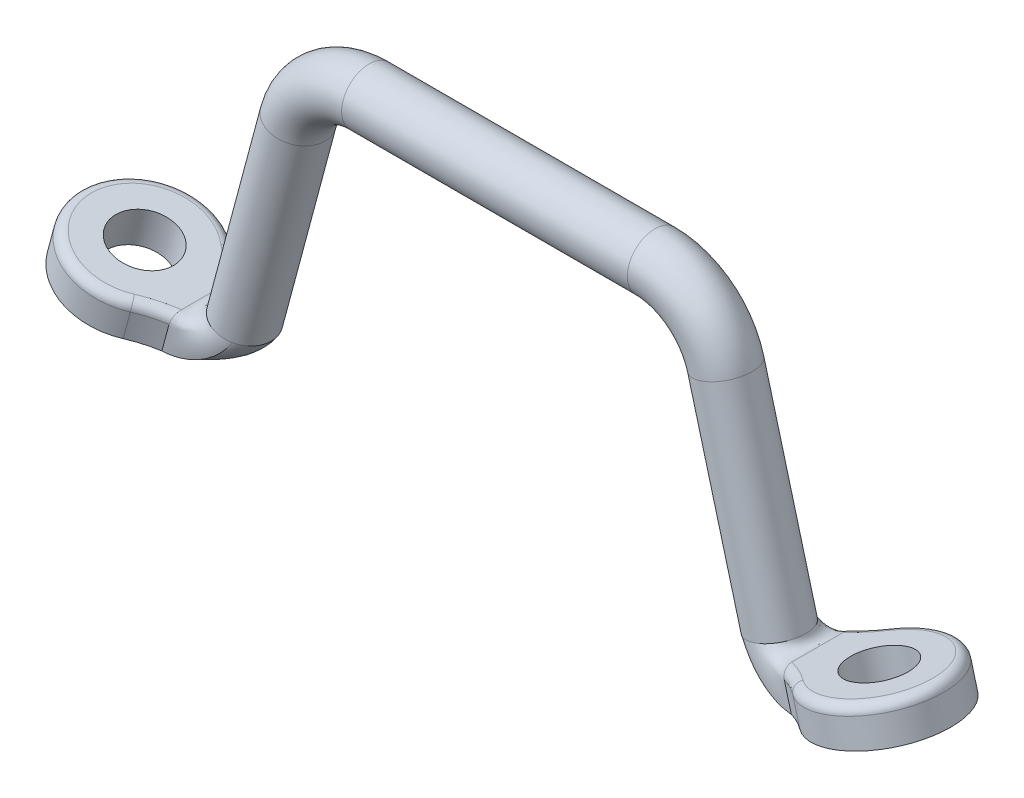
ISO-10303-21;
HEADER;
FILE_DESCRIPTION(('STEP AP214'),'2;1');
FILE_NAME('part.step','',(''),(''),'','','');
FILE_SCHEMA(('AUTOMOTIVE_DESIGN { 1 0 10303 214 1 1 1 1 }'));
ENDSEC;
DATA;
#1=APPLICATION_CONTEXT('core data for automotive mechanical design processes');
#2=APPLICATION_PROTOCOL_DEFINITION('international standard','automotive_design',2000,#1);
#3=PRODUCT_CONTEXT('',#1,'mechanical');
#4=PRODUCT('Part','Part','',(#3));
#5=PRODUCT_RELATED_PRODUCT_CATEGORY('part','',(#4));
#6=PRODUCT_DEFINITION_FORMATION('','',#4);
#7=PRODUCT_DEFINITION_CONTEXT('part definition',#1,'design');
#8=PRODUCT_DEFINITION('design','',#6,#7);
#9=PRODUCT_DEFINITION_SHAPE('','',#8);
#10=(LENGTH_UNIT() NAMED_UNIT(*) SI_UNIT(.MILLI.,.METRE.));
#11=(NAMED_UNIT(*) PLANE_ANGLE_UNIT() SI_UNIT($,.RADIAN.));
#12=(NAMED_UNIT(*) SI_UNIT($,.STERADIAN.) SOLID_ANGLE_UNIT());
#13=UNCERTAINTY_MEASURE_WITH_UNIT(LENGTH_MEASURE(1.E-05),#10,'distance_accuracy_value','');
#14=(GEOMETRIC_REPRESENTATION_CONTEXT(3) GLOBAL_UNCERTAINTY_ASSIGNED_CONTEXT((#13)) GLOBAL_UNIT_ASSIGNED_CONTEXT((#10,
#11,#12)) REPRESENTATION_CONTEXT('',''));
#15=CARTESIAN_POINT('',(0.,0.,0.));
#16=DIRECTION('',(0.,0.,1.));
#17=DIRECTION('',(1.,0.,0.));
#18=AXIS2_PLACEMENT_3D('',#15,#16,#17);
#19=CARTESIAN_POINT('',(-36.9678104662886,43.4924142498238,0.));
#20=DIRECTION('',(-0.258819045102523,-0.965925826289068,0.));
#21=DIRECTION('',(0.965925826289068,-0.258819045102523,0.));
#22=AXIS2_PLACEMENT_3D('',#19,#20,#21);
#23=CYLINDRICAL_SURFACE('',#22,4.7625);
#24=CARTESIAN_POINT('',(-36.9678104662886,43.4924142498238,0.));
#25=DIRECTION('',(0.258819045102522,0.965925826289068,0.));
#26=DIRECTION('',(0.,0.,-1.));
#27=AXIS2_PLACEMENT_3D('',#24,#25,#26);
#28=CIRCLE('',#27,4.7625);
#29=CARTESIAN_POINT('',(-41.5680322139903,44.7250399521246,0.));
#30=VERTEX_POINT('',#29);
#31=EDGE_CURVE('E209',#30,#30,#28,.T.);
#32=ORIENTED_EDGE('',*,*,#31,.F.);
#33=EDGE_LOOP('',(#32));
#34=FACE_BOUND('',#33,.T.);
#35=CARTESIAN_POINT('',(-41.6366887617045,7.66703624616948,3.37171696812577E-11));
#36=CARTESIAN_POINT('',(-41.6366887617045,7.66703624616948,0.43190975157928));
#37=CARTESIAN_POINT('',(-41.750870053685,7.6976310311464,1.29694829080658));
#38=CARTESIAN_POINT('',(-42.2545460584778,7.83259060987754,2.50091926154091));
#39=CARTESIAN_POINT('',(-43.0537578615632,8.04673876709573,3.52040098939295));
#40=CARTESIAN_POINT('',(-43.7437038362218,8.2316092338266,4.02574657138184));
#41=CARTESIAN_POINT('',(-44.114906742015,8.33107275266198,4.22554287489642));
#42=B_SPLINE_CURVE_WITH_KNOTS('',3,(#35,#36,#37,#38,#39,#40,#41),.UNSPECIFIED.,.F.,.F.,(4,1,1,1,
4),(0.,0.0429918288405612,0.0859836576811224,0.128975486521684,0.171967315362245),.UNSPECIFIED.);
#43=CARTESIAN_POINT('',(-44.1148198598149,8.33104947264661,4.22571713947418));
#44=VERTEX_POINT('',#43);
#45=CARTESIAN_POINT('',(-41.6366887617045,7.66703624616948,3.37171696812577E-11));
#46=VERTEX_POINT('',#45);
#47=EDGE_CURVE('E15',#44,#46,#42,.F.);
#48=ORIENTED_EDGE('',*,*,#47,.T.);
#49=CARTESIAN_POINT('',(-46.2369105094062,8.89966194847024,0.));
#50=DIRECTION('',(0.258819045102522,0.965925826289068,0.));
#51=DIRECTION('',(0.,0.,-1.));
#52=AXIS2_PLACEMENT_3D('',#49,#50,#51);
#53=CIRCLE('',#52,4.7625);
#54=CARTESIAN_POINT('',(-44.1345112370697,8.33632576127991,-4.23626715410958));
#55=VERTEX_POINT('',#54);
#56=EDGE_CURVE('E868',#46,#55,#53,.T.);
#57=ORIENTED_EDGE('',*,*,#56,.T.);
#58=EDGE_CURVE('E216',#55,#44,#53,.T.);
#59=ORIENTED_EDGE('',*,*,#58,.T.);
#60=EDGE_LOOP('',(#48,#57,#59));
#61=FACE_BOUND('',#60,.T.);
#62=ADVANCED_FACE('F199',(#34,#61),#23,.T.);
#63=CARTESIAN_POINT('',(-24.7005524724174,40.2054123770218,0.));
#64=DIRECTION('',(0.,0.,1.));
#65=DIRECTION('',(1.,0.,0.));
#66=AXIS2_PLACEMENT_3D('',#63,#64,#65);
#67=TOROIDAL_SURFACE('',#66,12.7,4.7625);
#68=CARTESIAN_POINT('',(-24.7005524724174,52.9054123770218,0.));
#69=DIRECTION('',(1.,0.,0.));
#70=DIRECTION('',(0.,0.,-1.));
#71=AXIS2_PLACEMENT_3D('',#68,#69,#70);
#72=CIRCLE('',#71,4.7625);
#73=CARTESIAN_POINT('',(-24.7005524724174,57.6679123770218,0.));
#74=VERTEX_POINT('',#73);
#75=EDGE_CURVE('E862',#74,#74,#72,.T.);
#76=CARTESIAN_POINT('',(-24.7005524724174,40.2054123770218,0.));
#77=DIRECTION('',(0.,0.,1.));
#78=DIRECTION('',(1.,0.,0.));
#79=AXIS2_PLACEMENT_3D('',#76,#77,#78);
#80=CIRCLE('',#79,17.4625);
#81=EDGE_CURVE('',#74,#30,#80,.T.);
#82=ORIENTED_EDGE('',*,*,#75,.F.);
#83=ORIENTED_EDGE('',*,*,#31,.T.);
#84=ORIENTED_EDGE('',*,*,#81,.T.);
#85=ORIENTED_EDGE('',*,*,#81,.F.);
#86=EDGE_LOOP('',(#82,#84,#83,#85));
#87=FACE_BOUND('',#86,.T.);
#88=ADVANCED_FACE('F1020',(#87),#67,.T.);
#89=CARTESIAN_POINT('',(-24.7005524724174,52.9054123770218,0.));
#90=DIRECTION('',(1.,0.,0.));
#91=DIRECTION('',(0.,1.,0.));
#92=AXIS2_PLACEMENT_3D('',#89,#90,#91);
#93=CYLINDRICAL_SURFACE('',#92,4.7625);
#94=ORIENTED_EDGE('',*,*,#75,.T.);
#95=EDGE_LOOP('',(#94));
#96=FACE_BOUND('',#95,.T.);
#97=CARTESIAN_POINT('',(24.7005524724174,52.9054123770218,0.));
#98=DIRECTION('',(1.,0.,0.));
#99=DIRECTION('',(0.,0.,-1.));
#100=AXIS2_PLACEMENT_3D('',#97,#98,#99);
#101=CIRCLE('',#100,4.7625);
#102=CARTESIAN_POINT('',(24.7005524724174,57.6679123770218,0.));
#103=VERTEX_POINT('',#102);
#104=EDGE_CURVE('E682',#103,#103,#101,.T.);
#105=ORIENTED_EDGE('',*,*,#104,.F.);
#106=EDGE_LOOP('',(#105));
#107=FACE_BOUND('',#106,.T.);
#108=ADVANCED_FACE('F1025',(#96,#107),#93,.T.);
#109=CARTESIAN_POINT('',(-44.1346026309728,8.33635025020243,-4.23608165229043));
#110=CARTESIAN_POINT('',(-46.3908461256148,4.52932778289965,-4.89693733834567));
#111=CARTESIAN_POINT('',(-50.5172591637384,2.43586817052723,-5.55779302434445));
#112=CARTESIAN_POINT('',(-54.424915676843,2.87612663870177,-6.21864871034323));
#113=CARTESIAN_POINT('',(-43.7608305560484,8.23619832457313,-4.03726567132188));
#114=CARTESIAN_POINT('',(-46.1008469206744,4.3803956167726,-4.59165310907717));
#115=CARTESIAN_POINT('',(-50.3775171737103,2.3124782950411,-5.14604054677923));
#116=CARTESIAN_POINT('',(-54.424915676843,2.87612663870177,-5.70042798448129));
#117=CARTESIAN_POINT('',(-43.0667619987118,8.05022321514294,-3.53332565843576));
#118=CARTESIAN_POINT('',(-45.561294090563,4.10173624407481,-3.90996700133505));
#119=CARTESIAN_POINT('',(-50.1176383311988,2.08104847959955,-4.28660834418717));
#120=CARTESIAN_POINT('',(-54.424915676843,2.87612663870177,-4.66324968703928));
#121=CARTESIAN_POINT('',(-42.2621496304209,7.83462798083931,-2.5144498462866));
#122=CARTESIAN_POINT('',(-44.9321246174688,3.77128241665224,-2.71194282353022));
#123=CARTESIAN_POINT('',(-49.8150018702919,1.80463897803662,-2.90943580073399));
#124=CARTESIAN_POINT('',(-54.4249156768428,2.87612663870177,-3.10692877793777));
#125=CARTESIAN_POINT('',(-41.7531150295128,7.69823257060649,-1.30749911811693));
#126=CARTESIAN_POINT('',(-44.5306203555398,3.55525163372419,-1.38890541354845));
#127=CARTESIAN_POINT('',(-49.6222548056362,1.62213384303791,-1.47031170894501));
#128=CARTESIAN_POINT('',(-54.424915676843,2.87612663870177,-1.55171800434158));
#129=CARTESIAN_POINT('',(-41.6366887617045,7.66703624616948,-0.43626660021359));
#130=CARTESIAN_POINT('',(-44.4373891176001,3.50302444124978,-0.463095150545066));
#131=CARTESIAN_POINT('',(-49.5776503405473,1.57730580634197,-0.489923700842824));
#132=CARTESIAN_POINT('',(-54.424915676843,2.87612663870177,-0.516752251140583));
#133=CARTESIAN_POINT('',(-41.6366887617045,7.66703624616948,3.37171696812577E-11));
#134=CARTESIAN_POINT('',(-44.4373891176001,3.50302444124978,0.));
#135=CARTESIAN_POINT('',(-49.5776503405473,1.57730580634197,0.));
#136=CARTESIAN_POINT('',(-54.424915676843,2.87612663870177,0.));
#137=B_SPLINE_SURFACE_WITH_KNOTS('',3,3,((#109,#110,#111,#112),(#113,#114,#115,#116),(#117,#118,
#119,#120),(#121,#122,#123,#124),(#125,#126,#127,#128),(#129,#130,#131,#132),(#133,#134,#135,
#136)),.UNSPECIFIED.,.F.,.F.,.F.,(4,1,1,1,4),(4,4),(0.826297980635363,0.869723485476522,
0.913148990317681,0.956574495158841,1.),(0.,1.),.UNSPECIFIED.);
#138=CARTESIAN_POINT('',(-41.6366887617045,7.66703624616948,3.37171696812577E-11));
#139=CARTESIAN_POINT('',(-44.4373891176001,3.50302444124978,0.));
#140=CARTESIAN_POINT('',(-49.5776503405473,1.57730580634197,0.));
#141=CARTESIAN_POINT('',(-54.424915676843,2.87612663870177,0.));
#142=B_SPLINE_CURVE_WITH_KNOTS('',3,(#138,#139,#140,#141),.UNSPECIFIED.,.F.,.F.,(4,4),(0.,1.),.UNSPECIFIED.);
#143=CARTESIAN_POINT('',(-54.424915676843,2.87612663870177,0.));
#144=VERTEX_POINT('',#143);
#145=EDGE_CURVE('E889',#46,#144,#142,.T.);
#146=DIRECTION('',(0.,0.,-1.));
#147=VECTOR('',#146,1.);
#148=CARTESIAN_POINT('',(-54.424915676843,2.87612663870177,11.1125));
#149=LINE('',#148,#147);
#150=CARTESIAN_POINT('',(-54.4249156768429,2.87612663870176,-6.21864871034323));
#151=VERTEX_POINT('',#150);
#152=EDGE_CURVE('E244',#144,#151,#149,.T.);
#153=CARTESIAN_POINT('',(-44.1346026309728,8.33635025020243,-4.23608165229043));
#154=CARTESIAN_POINT('',(-46.3908461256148,4.52932778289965,-4.89693733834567));
#155=CARTESIAN_POINT('',(-50.5172591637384,2.43586817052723,-5.55779302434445));
#156=CARTESIAN_POINT('',(-54.424915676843,2.87612663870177,-6.21864871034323));
#157=B_SPLINE_CURVE_WITH_KNOTS('',3,(#153,#154,#155,#156),.UNSPECIFIED.,.F.,.F.,(4,4),(0.,1.),.UNSPECIFIED.);
#158=EDGE_CURVE('E882',#55,#151,#157,.T.);
#159=ORIENTED_EDGE('',*,*,#56,.F.);
#160=ORIENTED_EDGE('',*,*,#145,.T.);
#161=ORIENTED_EDGE('',*,*,#152,.T.);
#162=ORIENTED_EDGE('',*,*,#158,.F.);
#163=EDGE_LOOP('',(#159,#160,#161,#162));
#164=FACE_BOUND('',#163,.T.);
#165=ADVANCED_FACE('F851',(#164),#137,.T.);
#166=CARTESIAN_POINT('',(-44.114906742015,8.33107275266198,4.22554287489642));
#167=CARTESIAN_POINT('',(-46.3755232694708,4.52139653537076,4.85752116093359));
#168=CARTESIAN_POINT('',(-50.5098801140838,2.4292749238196,5.48949944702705));
#169=CARTESIAN_POINT('',(-54.4249156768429,2.87612663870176,6.12147773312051));
#170=CARTESIAN_POINT('',(-44.4037020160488,8.40845521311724,4.38098408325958));
#171=CARTESIAN_POINT('',(-46.5653608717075,4.76427134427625,4.96114863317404));
#172=CARTESIAN_POINT('',(-50.5493760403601,2.78020014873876,5.54131318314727));
#173=CARTESIAN_POINT('',(-54.3221968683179,3.25947845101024,6.12147773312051));
#174=CARTESIAN_POINT('',(-45.0159742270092,8.57251305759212,4.62947026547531));
#175=CARTESIAN_POINT('',(-46.9713637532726,5.26094163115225,5.12680608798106));
#176=CARTESIAN_POINT('',(-50.6416089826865,3.48930846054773,5.62414191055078));
#177=CARTESIAN_POINT('',(-54.1176622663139,4.022811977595,6.12147773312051));
#178=CARTESIAN_POINT('',(-45.9921644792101,8.83408244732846,4.79212465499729));
#179=CARTESIAN_POINT('',(-47.6240600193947,6.02539169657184,5.2352423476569));
#180=CARTESIAN_POINT('',(-50.8015027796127,4.56737005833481,5.6783600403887));
#181=CARTESIAN_POINT('',(-53.8115315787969,5.16530725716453,6.12147773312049));
#182=CARTESIAN_POINT('',(-46.9748762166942,9.09739926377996,4.73704332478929));
#183=CARTESIAN_POINT('',(-48.2818416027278,6.79501639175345,5.19852146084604));
#184=CARTESIAN_POINT('',(-50.9631283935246,5.65189011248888,5.65999959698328));
#185=CARTESIAN_POINT('',(-53.5040824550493,6.31272300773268,6.12147773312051));
#186=CARTESIAN_POINT('',(-47.6006830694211,9.26508370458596,4.56043680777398));
#187=CARTESIAN_POINT('',(-48.6983243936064,7.30219283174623,5.08078378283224));
#188=CARTESIAN_POINT('',(-51.0589518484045,6.37409738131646,5.60113075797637));
#189=CARTESIAN_POINT('',(-53.2968554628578,7.08610467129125,6.12147773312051));
#190=CARTESIAN_POINT('',(-48.0541988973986,9.38660290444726,4.37852809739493));
#191=CARTESIAN_POINT('',(-48.9980280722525,7.68244353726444,4.95951130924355));
#192=CARTESIAN_POINT('',(-51.1227978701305,6.92136131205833,5.54049452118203));
#193=CARTESIAN_POINT('',(-53.1378202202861,7.67963227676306,6.12147773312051));
#194=CARTESIAN_POINT('',(-48.3500388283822,9.46587297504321,4.23995164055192));
#195=CARTESIAN_POINT('',(-49.1920488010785,7.94220702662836,4.83446009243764));
#196=CARTESIAN_POINT('',(-51.1597270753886,7.29982955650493,5.42896854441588));
#197=CARTESIAN_POINT('',(-53.0263998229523,8.09545886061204,6.02347699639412));
#198=CARTESIAN_POINT('',(-48.760493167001,9.57585388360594,3.99195789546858));
#199=CARTESIAN_POINT('',(-49.467794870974,8.28709523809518,4.53212281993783));
#200=CARTESIAN_POINT('',(-51.2215383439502,7.79105810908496,5.07228774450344));
#201=CARTESIAN_POINT('',(-52.886806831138,8.61642699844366,5.61245266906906));
#202=CARTESIAN_POINT('',(-49.1441920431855,9.67866568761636,3.70187901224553));
#203=CARTESIAN_POINT('',(-49.7404684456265,8.55605208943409,4.14318745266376));
#204=CARTESIAN_POINT('',(-51.3085105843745,8.14268002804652,4.58449589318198));
#205=CARTESIAN_POINT('',(-52.7998885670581,8.94081037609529,5.02580433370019));
#206=CARTESIAN_POINT('',(-49.3851133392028,9.74322035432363,3.47682702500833));
#207=CARTESIAN_POINT('',(-49.9232714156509,8.67913079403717,3.8493024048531));
#208=CARTESIAN_POINT('',(-51.3870239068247,8.27266807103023,4.22177778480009));
#209=CARTESIAN_POINT('',(-52.7814147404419,9.00975563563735,4.59425316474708));
#210=CARTESIAN_POINT('',(-49.7094485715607,9.83012571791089,3.13843616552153));
#211=CARTESIAN_POINT('',(-50.1769262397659,8.81241509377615,3.42941204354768));
#212=CARTESIAN_POINT('',(-51.5090299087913,8.3841750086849,3.72038792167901));
#213=CARTESIAN_POINT('',(-52.7814147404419,9.00975563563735,4.01136379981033));
#214=CARTESIAN_POINT('',(-50.0875746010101,9.93144428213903,2.66064660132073));
#215=CARTESIAN_POINT('',(-50.4727974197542,8.96810214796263,2.86530134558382));
#216=CARTESIAN_POINT('',(-51.6513254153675,8.51450134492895,3.06995608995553));
#217=CARTESIAN_POINT('',(-52.7814147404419,9.00975563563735,3.27461083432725));
#218=CARTESIAN_POINT('',(-50.5148603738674,10.0459351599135,1.83335713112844));
#219=CARTESIAN_POINT('',(-50.8083490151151,9.14647469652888,1.94974889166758));
#220=CARTESIAN_POINT('',(-51.8125714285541,8.66444938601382,2.06614065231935));
#221=CARTESIAN_POINT('',(-52.7814147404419,9.00975563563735,2.18253241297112));
#222=CARTESIAN_POINT('',(-50.7786166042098,10.1166084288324,0.93171344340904));
#223=CARTESIAN_POINT('',(-51.0169549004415,9.25955134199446,0.986009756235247));
#224=CARTESIAN_POINT('',(-51.9126535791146,8.7602635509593,1.04030606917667));
#225=CARTESIAN_POINT('',(-52.7814147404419,9.00975563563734,1.09460238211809));
#226=CARTESIAN_POINT('',(-50.8371322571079,10.132287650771,0.309285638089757));
#227=CARTESIAN_POINT('',(-51.0639004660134,9.28597717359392,0.328309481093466));
#228=CARTESIAN_POINT('',(-51.9351042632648,8.78298742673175,0.347333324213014));
#229=CARTESIAN_POINT('',(-52.7814147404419,9.00975563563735,0.366357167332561));
#230=CARTESIAN_POINT('',(-50.8371322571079,10.132287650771,-0.316112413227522));
#231=CARTESIAN_POINT('',(-51.0639004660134,9.28597717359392,-0.335556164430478));
#232=CARTESIAN_POINT('',(-51.9351042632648,8.78298742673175,-0.354999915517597));
#233=CARTESIAN_POINT('',(-52.7814147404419,9.00975563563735,-0.374443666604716));
#234=CARTESIAN_POINT('',(-50.7760345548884,10.1159165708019,-0.950444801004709));
#235=CARTESIAN_POINT('',(-51.0149708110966,9.25856125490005,-1.00730166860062));
#236=CARTESIAN_POINT('',(-51.9116953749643,8.7594536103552,-1.06415853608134));
#237=CARTESIAN_POINT('',(-52.7814147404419,9.00975563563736,-1.12101540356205));
#238=CARTESIAN_POINT('',(-50.503182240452,10.0428060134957,-1.86459454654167));
#239=CARTESIAN_POINT('',(-50.7992658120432,9.1417762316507,-1.98982690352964));
#240=CARTESIAN_POINT('',(-51.8081969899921,8.66054464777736,-2.11505926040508));
#241=CARTESIAN_POINT('',(-52.781414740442,9.00975563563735,-2.24029161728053));
#242=CARTESIAN_POINT('',(-50.0630242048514,9.92486602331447,-2.69988730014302));
#243=CARTESIAN_POINT('',(-50.4536038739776,8.95802680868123,-2.9216952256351));
#244=CARTESIAN_POINT('',(-51.6420927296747,8.50607572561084,-3.14350315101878));
#245=CARTESIAN_POINT('',(-52.7814147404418,9.00975563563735,-3.36531107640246));
#246=CARTESIAN_POINT('',(-49.6739561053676,9.82061554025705,-3.18052421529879));
#247=CARTESIAN_POINT('',(-50.149187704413,8.79786839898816,-3.49487625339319));
#248=CARTESIAN_POINT('',(-51.4956857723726,8.37201514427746,-3.80922829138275));
#249=CARTESIAN_POINT('',(-52.7814147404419,9.00975563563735,-4.12358032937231));
#250=CARTESIAN_POINT('',(-49.3441740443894,9.73225070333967,-3.51592427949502));
#251=CARTESIAN_POINT('',(-49.8913499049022,8.66250045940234,-3.91562728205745));
#252=CARTESIAN_POINT('',(-51.3716593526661,8.25880505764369,-4.31533028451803));
#253=CARTESIAN_POINT('',(-52.7814147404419,9.00975563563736,-4.7150332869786));
#254=CARTESIAN_POINT('',(-49.1053218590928,9.66825045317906,-3.7338212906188));
#255=CARTESIAN_POINT('',(-49.7103258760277,8.53991212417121,-4.20369197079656));
#256=CARTESIAN_POINT('',(-51.294177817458,8.12873247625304,-4.67356265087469));
#257=CARTESIAN_POINT('',(-52.8002454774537,8.93947836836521,-5.14343333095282));
#258=CARTESIAN_POINT('',(-48.7263748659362,9.56671191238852,-4.01447020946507));
#259=CARTESIAN_POINT('',(-49.4417085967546,8.27189903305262,-4.58361838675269));
#260=CARTESIAN_POINT('',(-51.2095993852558,7.776643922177,-5.15276656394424));
#261=CARTESIAN_POINT('',(-52.8880479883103,8.61179493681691,-5.72191474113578));
#262=CARTESIAN_POINT('',(-48.3220699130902,9.45837872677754,-4.25439878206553));
#263=CARTESIAN_POINT('',(-49.1707278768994,7.92985966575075,-4.87834997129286));
#264=CARTESIAN_POINT('',(-51.1499687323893,7.28812307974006,-5.5023011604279));
#265=CARTESIAN_POINT('',(-53.0274267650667,8.09162626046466,-6.12625234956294));
#266=CARTESIAN_POINT('',(-48.0311432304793,9.38042515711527,-4.38858152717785));
#267=CARTESIAN_POINT('',(-48.9803437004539,7.67288748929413,-4.99860392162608));
#268=CARTESIAN_POINT('',(-51.1144748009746,6.91288737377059,-5.60862631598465));
#269=CARTESIAN_POINT('',(-53.1382273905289,7.67811269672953,-6.21864871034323));
#270=CARTESIAN_POINT('',(-47.5830941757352,9.26037077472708,-4.56576443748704));
#271=CARTESIAN_POINT('',(-48.6847668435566,7.29539626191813,-5.11672586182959));
#272=CARTESIAN_POINT('',(-51.0523998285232,6.36854200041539,-5.66768728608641));
#273=CARTESIAN_POINT('',(-53.2968385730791,7.08616770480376,-6.21864871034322));
#274=CARTESIAN_POINT('',(-46.9638341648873,9.09444055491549,-4.7380569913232));
#275=CARTESIAN_POINT('',(-48.2733684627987,6.79086867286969,-5.23158756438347));
#276=CARTESIAN_POINT('',(-50.9590172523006,5.64855786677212,-5.72511813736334));
#277=CARTESIAN_POINT('',(-53.5040497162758,6.31284519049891,-6.21864871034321));
#278=CARTESIAN_POINT('',(-45.9922635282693,8.83410898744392,-4.7913119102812));
#279=CARTESIAN_POINT('',(-47.6242004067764,6.02560913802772,-5.26709084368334));
#280=CARTESIAN_POINT('',(-50.8015491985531,4.56762714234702,-5.74286977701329));
#281=CARTESIAN_POINT('',(-53.8115054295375,5.16540484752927,-6.21864871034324));
#282=CARTESIAN_POINT('',(-45.0270050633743,8.57546876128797,-4.63172425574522));
#283=CARTESIAN_POINT('',(-46.9799529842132,5.26541424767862,-5.16069907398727));
#284=CARTESIAN_POINT('',(-50.6457400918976,3.49304373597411,-5.68967389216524));
#285=CARTESIAN_POINT('',(-54.117654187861,4.02284212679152,-6.21864871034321));
#286=CARTESIAN_POINT('',(-44.420852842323,8.41305076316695,-4.38834320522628));
#287=CARTESIAN_POINT('',(-46.5786999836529,4.77117017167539,-4.99844504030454));
#288=CARTESIAN_POINT('',(-50.5558001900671,2.78593314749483,-5.60854687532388));
#289=CARTESIAN_POINT('',(-54.3221968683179,3.25947845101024,-6.21864871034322));
#290=CARTESIAN_POINT('',(-44.1346026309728,8.33635025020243,-4.23608165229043));
#291=CARTESIAN_POINT('',(-46.3908461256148,4.52932778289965,-4.89693733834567));
#292=CARTESIAN_POINT('',(-50.5172591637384,2.43586817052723,-5.55779302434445));
#293=CARTESIAN_POINT('',(-54.424915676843,2.87612663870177,-6.21864871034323));
#294=B_SPLINE_SURFACE_WITH_KNOTS('',3,3,((#166,#167,#168,#169),(#170,#171,#172,#173),(#174,#175,
#176,#177),(#178,#179,#180,#181),(#182,#183,#184,#185),(#186,#187,#188,#189),(#190,#191,#192,
#193),(#194,#195,#196,#197),(#198,#199,#200,#201),(#202,#203,#204,#205),(#206,#207,#208,#209),
(#210,#211,#212,#213),(#214,#215,#216,#217),(#218,#219,#220,#221),(#222,#223,#224,#225),(#226,
#227,#228,#229),(#230,#231,#232,#233),(#234,#235,#236,#237),(#238,#239,#240,#241),(#242,#243,
#244,#245),(#246,#247,#248,#249),(#250,#251,#252,#253),(#254,#255,#256,#257),(#258,#259,#260,
#261),(#262,#263,#264,#265),(#266,#267,#268,#269),(#270,#271,#272,#273),(#274,#275,#276,#277),
(#278,#279,#280,#281),(#282,#283,#284,#285),(#286,#287,#288,#289),(#290,#291,#292,#293)),
.UNSPECIFIED.,.F.,.F.,.F.,(4,1,1,1,2,1,1,1,2,1,1,1,2,1,1,1,2,1,1,1,2,1,1,1,4),(4,4),
(0.171967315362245,0.205414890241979,0.238862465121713,0.272310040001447,0.305757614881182,
0.323185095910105,0.340612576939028,0.358040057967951,0.375467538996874,0.406254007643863,
0.437040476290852,0.467826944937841,0.498613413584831,0.530079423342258,0.561545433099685,
0.593011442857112,0.624477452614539,0.641675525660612,0.658873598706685,0.676071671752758,
0.693269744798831,0.726526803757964,0.759783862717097,0.79304092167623,0.826297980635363),(0.,
1.),.UNSPECIFIED.);
#295=DIRECTION('',(0.25881904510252,0.965925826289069,0.));
#296=VECTOR('',#295,1.);
#297=CARTESIAN_POINT('',(-55.8629789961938,-2.49079873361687,-6.21864871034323));
#298=LINE('',#297,#296);
#299=CARTESIAN_POINT('',(-53.1922899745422,7.47634838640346,-6.21864871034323));
#300=VERTEX_POINT('',#299);
#301=EDGE_CURVE('E712',#151,#300,#298,.T.);
#302=CARTESIAN_POINT('',(-53.1922899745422,7.47634838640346,-6.21864871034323));
#303=CARTESIAN_POINT('',(-53.1813752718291,7.51708261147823,-6.21865044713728));
#304=CARTESIAN_POINT('',(-53.1704660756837,7.55779628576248,-6.21682174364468));
#305=CARTESIAN_POINT('',(-53.1487314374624,7.63891105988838,-6.20953996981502));
#306=CARTESIAN_POINT('',(-53.1379059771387,7.67931222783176,-6.20408771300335));
#307=CARTESIAN_POINT('',(-53.1057400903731,7.79935695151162,-6.18240519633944));
#308=CARTESIAN_POINT('',(-53.0846246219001,7.87816095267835,-6.16084853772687));
#309=CARTESIAN_POINT('',(-53.0436471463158,8.03109097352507,-6.10443057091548));
#310=CARTESIAN_POINT('',(-53.0237846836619,8.10521869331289,-6.06957413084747));
#311=CARTESIAN_POINT('',(-52.9857772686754,8.24706429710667,-5.98788381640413));
#312=CARTESIAN_POINT('',(-52.9676331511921,8.31477906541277,-5.94104416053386));
#313=CARTESIAN_POINT('',(-52.9328786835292,8.4444845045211,-5.83519904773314));
#314=CARTESIAN_POINT('',(-52.9163427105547,8.50619759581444,-5.77583005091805));
#315=CARTESIAN_POINT('',(-52.8858648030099,8.61994269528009,-5.64787971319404));
#316=CARTESIAN_POINT('',(-52.8719236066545,8.67197194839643,-5.57929576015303));
#317=CARTESIAN_POINT('',(-52.8459331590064,8.76896961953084,-5.42939734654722));
#318=CARTESIAN_POINT('',(-52.8341037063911,8.81311773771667,-5.34751420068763));
#319=CARTESIAN_POINT('',(-52.8139170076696,8.88845552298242,-5.17757770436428));
#320=CARTESIAN_POINT('',(-52.8055608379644,8.91964117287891,-5.08952245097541));
#321=CARTESIAN_POINT('',(-52.7931717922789,8.96587772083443,-4.91928569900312));
#322=CARTESIAN_POINT('',(-52.7887684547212,8.98231120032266,-4.83750221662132));
#323=CARTESIAN_POINT('',(-52.7828895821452,9.00425145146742,-4.67248782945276));
#324=CARTESIAN_POINT('',(-52.7814102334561,9.00977245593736,-4.58925895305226));
#325=CARTESIAN_POINT('',(-52.7814147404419,9.00975563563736,-4.50601695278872));
#326=B_SPLINE_CURVE_WITH_KNOTS('',3,(#302,#303,#304,#305,#306,#307,#308,#309,#310,#311,#312,
#313,#314,#315,#316,#317,#318,#319,#320,#321,#322,#323,#324,#325),.UNSPECIFIED.,.F.,.F.,(4,2,2,
2,2,2,2,2,2,2,2,4),(0.,0.126432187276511,0.252835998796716,0.50466534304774,0.756402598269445,
1.0082615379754,1.26879751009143,1.52940749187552,1.80952941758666,2.08973809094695,
2.33957145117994,2.58907874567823),.UNSPECIFIED.);
#327=CARTESIAN_POINT('',(-52.7814147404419,9.00975563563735,-4.50601695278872));
#328=VERTEX_POINT('',#327);
#329=EDGE_CURVE('E836',#300,#328,#326,.T.);
#330=DIRECTION('',(0.,0.,-1.));
#331=VECTOR('',#330,1.);
#332=CARTESIAN_POINT('',(-52.7814147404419,9.00975563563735,11.1125));
#333=LINE('',#332,#331);
#334=CARTESIAN_POINT('',(-52.7814147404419,9.00975563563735,4.38359305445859));
#335=VERTEX_POINT('',#334);
#336=EDGE_CURVE('E203',#335,#328,#333,.T.);
#337=CARTESIAN_POINT('',(-52.7814147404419,9.00975563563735,4.38359305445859));
#338=CARTESIAN_POINT('',(-52.7814045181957,9.0097937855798,4.48809405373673));
#339=CARTESIAN_POINT('',(-52.7836736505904,9.00132526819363,4.59260514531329));
#340=CARTESIAN_POINT('',(-52.7926748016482,8.96773251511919,4.79890235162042));
#341=CARTESIAN_POINT('',(-52.799414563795,8.94257938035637,4.90068341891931));
#342=CARTESIAN_POINT('',(-52.8172700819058,8.87594167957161,5.09849849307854));
#343=CARTESIAN_POINT('',(-52.8283905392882,8.83443956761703,5.19452619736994));
#344=CARTESIAN_POINT('',(-52.8548054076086,8.73585793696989,5.37755098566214));
#345=CARTESIAN_POINT('',(-52.8700965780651,8.67879051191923,5.46455500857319));
#346=CARTESIAN_POINT('',(-52.9038574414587,8.55279325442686,5.6230880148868));
#347=CARTESIAN_POINT('',(-52.9221759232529,8.48442774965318,5.69509602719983));
#348=CARTESIAN_POINT('',(-52.9619575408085,8.33596073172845,5.82481283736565));
#349=CARTESIAN_POINT('',(-52.9834199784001,8.25586182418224,5.88252480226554));
#350=CARTESIAN_POINT('',(-53.0268223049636,8.09388213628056,5.97636911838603));
#351=CARTESIAN_POINT('',(-53.0485511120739,8.01278912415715,6.01396118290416));
#352=CARTESIAN_POINT('',(-53.093413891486,7.84535895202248,6.0729599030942));
#353=CARTESIAN_POINT('',(-53.1165447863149,7.75903327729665,6.09440071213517));
#354=CARTESIAN_POINT('',(-53.1486304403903,7.63928798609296,6.11196799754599));
#355=CARTESIAN_POINT('',(-53.1573431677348,7.60677164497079,6.11553351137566));
#356=CARTESIAN_POINT('',(-53.1747990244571,7.54162550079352,6.1202856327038));
#357=CARTESIAN_POINT('',(-53.1835420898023,7.5089959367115,6.12147575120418));
#358=CARTESIAN_POINT('',(-53.1922899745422,7.47634838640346,6.12147773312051));
#359=B_SPLINE_CURVE_WITH_KNOTS('',3,(#337,#338,#339,#340,#341,#342,#343,#344,#345,#346,#347,
#348,#349,#350,#351,#352,#353,#354,#355,#356,#357,#358),.UNSPECIFIED.,.F.,.F.,(4,2,2,2,2,2,2,2,
2,2,4),(0.,0.313160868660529,0.626865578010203,0.940907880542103,1.2547068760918,
1.5559821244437,1.85719057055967,2.13169081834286,2.40560896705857,2.50709887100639,
2.60843865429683),.UNSPECIFIED.);
#360=CARTESIAN_POINT('',(-53.1922899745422,7.47634838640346,6.12147773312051));
#361=VERTEX_POINT('',#360);
#362=EDGE_CURVE('E723',#335,#361,#359,.T.);
#363=DIRECTION('',(0.25881904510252,0.965925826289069,0.));
#364=VECTOR('',#363,1.);
#365=CARTESIAN_POINT('',(-55.8629789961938,-2.49079873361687,6.12147773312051));
#366=LINE('',#365,#364);
#367=CARTESIAN_POINT('',(-54.4249156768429,2.87612663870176,6.12147773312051));
#368=VERTEX_POINT('',#367);
#369=EDGE_CURVE('E795',#368,#361,#366,.T.);
#370=CARTESIAN_POINT('',(-44.114906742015,8.33107275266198,4.22554287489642));
#371=CARTESIAN_POINT('',(-46.3755232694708,4.52139653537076,4.85752116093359));
#372=CARTESIAN_POINT('',(-50.5098801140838,2.4292749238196,5.48949944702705));
#373=CARTESIAN_POINT('',(-54.4249156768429,2.87612663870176,6.12147773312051));
#374=B_SPLINE_CURVE_WITH_KNOTS('',3,(#370,#371,#372,#373),.UNSPECIFIED.,.F.,.F.,(4,4),(0.,1.),.UNSPECIFIED.);
#375=EDGE_CURVE('E789',#44,#368,#374,.T.);
#376=ORIENTED_EDGE('',*,*,#58,.F.);
#377=ORIENTED_EDGE('',*,*,#158,.T.);
#378=ORIENTED_EDGE('',*,*,#301,.T.);
#379=ORIENTED_EDGE('',*,*,#329,.T.);
#380=ORIENTED_EDGE('',*,*,#336,.F.);
#381=ORIENTED_EDGE('',*,*,#362,.T.);
#382=ORIENTED_EDGE('',*,*,#369,.F.);
#383=ORIENTED_EDGE('',*,*,#375,.F.);
#384=EDGE_LOOP('',(#376,#377,#378,#379,#380,#381,#382,#383));
#385=FACE_BOUND('',#384,.T.);
#386=ADVANCED_FACE('F750',(#385),#294,.T.);
#387=CARTESIAN_POINT('',(-41.6366887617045,7.66703624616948,3.37171696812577E-11));
#388=CARTESIAN_POINT('',(-44.4373891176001,3.50302444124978,0.));
#389=CARTESIAN_POINT('',(-49.5776503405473,1.57730580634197,0.));
#390=CARTESIAN_POINT('',(-54.424915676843,2.87612663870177,0.));
#391=CARTESIAN_POINT('',(-41.6366887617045,7.66703624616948,0.43190975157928));
#392=CARTESIAN_POINT('',(-44.4373891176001,3.50302444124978,0.458470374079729));
#393=CARTESIAN_POINT('',(-49.5776503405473,1.57730580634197,0.485030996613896));
#394=CARTESIAN_POINT('',(-54.424915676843,2.87612663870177,0.511591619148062));
#395=CARTESIAN_POINT('',(-41.750870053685,7.6976310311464,1.29694829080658));
#396=CARTESIAN_POINT('',(-44.5289841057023,3.55456960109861,1.37573187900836));
#397=CARTESIAN_POINT('',(-49.6214546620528,1.62162550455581,1.45451546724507));
#398=CARTESIAN_POINT('',(-54.424915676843,2.87612663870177,1.53329905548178));
#399=CARTESIAN_POINT('',(-42.2545460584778,7.83259060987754,2.50091926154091));
#400=CARTESIAN_POINT('',(-44.9263963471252,3.76859718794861,2.68831809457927));
#401=CARTESIAN_POINT('',(-49.8122226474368,1.8025062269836,2.87571692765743));
#402=CARTESIAN_POINT('',(-54.424915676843,2.87612663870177,3.06311576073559));
#403=CARTESIAN_POINT('',(-43.0537578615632,8.04673876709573,3.52040098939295));
#404=CARTESIAN_POINT('',(-45.5512441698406,4.09663440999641,3.87754729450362));
#405=CARTESIAN_POINT('',(-50.1127911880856,2.0768429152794,4.23469359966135));
#406=CARTESIAN_POINT('',(-54.424915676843,2.87612663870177,4.59183990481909));
#407=CARTESIAN_POINT('',(-43.7437038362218,8.2316092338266,4.02574657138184));
#408=CARTESIAN_POINT('',(-46.0875057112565,4.37346452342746,4.5542825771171));
#409=CARTESIAN_POINT('',(-50.3710943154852,2.3067073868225,5.08281858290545));
#410=CARTESIAN_POINT('',(-54.424915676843,2.87612663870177,5.6113545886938));
#411=CARTESIAN_POINT('',(-44.114906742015,8.33107275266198,4.22554287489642));
#412=CARTESIAN_POINT('',(-46.3755232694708,4.52139653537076,4.85752116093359));
#413=CARTESIAN_POINT('',(-50.5098801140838,2.4292749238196,5.48949944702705));
#414=CARTESIAN_POINT('',(-54.4249156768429,2.87612663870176,6.12147773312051));
#415=B_SPLINE_SURFACE_WITH_KNOTS('',3,3,((#387,#388,#389,#390),(#391,#392,#393,#394),(#395,#396,
#397,#398),(#399,#400,#401,#402),(#403,#404,#405,#406),(#407,#408,#409,#410),(#411,#412,#413,
#414)),.UNSPECIFIED.,.F.,.F.,.F.,(4,1,1,1,4),(4,4),(0.,0.0429918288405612,0.0859836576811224,
0.128975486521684,0.171967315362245),(0.,1.),.UNSPECIFIED.);
#416=EDGE_CURVE('E785',#368,#144,#149,.T.);
#417=ORIENTED_EDGE('',*,*,#47,.F.);
#418=ORIENTED_EDGE('',*,*,#375,.T.);
#419=ORIENTED_EDGE('',*,*,#416,.T.);
#420=ORIENTED_EDGE('',*,*,#145,.F.);
#421=EDGE_LOOP('',(#417,#418,#419,#420));
#422=FACE_BOUND('',#421,.T.);
#423=ADVANCED_FACE('F743',(#422),#415,.T.);
#424=CARTESIAN_POINT('',(-75.8926171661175,8.62837991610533,11.1125));
#425=DIRECTION('',(0.258819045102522,0.965925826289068,0.));
#426=DIRECTION('',(-0.965925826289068,0.258819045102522,0.));
#427=AXIS2_PLACEMENT_3D('',#424,#425,#426);
#428=PLANE('',#427);
#429=CARTESIAN_POINT('',(-65.1587664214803,5.75225327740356,0.));
#430=DIRECTION('',(0.258819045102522,0.965925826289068,0.));
#431=DIRECTION('',(-0.965925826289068,0.258819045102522,0.));
#432=AXIS2_PLACEMENT_3D('',#429,#430,#431);
#433=CIRCLE('',#432,5.159375);
#434=CARTESIAN_POINT('',(-70.1423399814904,7.08759778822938,0.));
#435=VERTEX_POINT('',#434);
#436=EDGE_CURVE('E689',#435,#435,#433,.T.);
#437=ORIENTED_EDGE('',*,*,#436,.T.);
#438=EDGE_LOOP('',(#437));
#439=FACE_BOUND('',#438,.T.);
#440=CARTESIAN_POINT('',(-45.711924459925,0.541487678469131,25.5175950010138));
#441=DIRECTION('',(0.258819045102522,0.965925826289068,0.));
#442=DIRECTION('',(-0.965925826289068,0.258819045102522,0.));
#443=AXIS2_PLACEMENT_3D('',#440,#441,#442);
#444=CIRCLE('',#443,21.3910289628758);
#445=CARTESIAN_POINT('',(-58.510164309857,3.97076571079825,8.72410730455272));
#446=VERTEX_POINT('',#445);
#447=EDGE_CURVE('E705',#446,#368,#444,.F.);
#448=ORIENTED_EDGE('',*,*,#447,.F.);
#449=CARTESIAN_POINT('',(-65.1587664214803,5.75225327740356,0.));
#450=DIRECTION('',(0.258819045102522,0.965925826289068,0.));
#451=DIRECTION('',(-0.965925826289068,0.258819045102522,0.));
#452=AXIS2_PLACEMENT_3D('',#449,#450,#451);
#453=CIRCLE('',#452,11.1125);
#454=CARTESIAN_POINT('',(-58.510164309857,3.97076571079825,-8.72410730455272));
#455=VERTEX_POINT('',#454);
#456=EDGE_CURVE('E699',#455,#446,#453,.T.);
#457=ORIENTED_EDGE('',*,*,#456,.F.);
#458=CARTESIAN_POINT('',(-47.4351872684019,1.0032345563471,-23.25637837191));
#459=DIRECTION('',(0.258819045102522,0.965925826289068,0.));
#460=DIRECTION('',(-0.965925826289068,0.258819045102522,0.));
#461=AXIS2_PLACEMENT_3D('',#458,#459,#460);
#462=CIRCLE('',#461,18.5107606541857);
#463=EDGE_CURVE('E709',#151,#455,#462,.F.);
#464=ORIENTED_EDGE('',*,*,#463,.F.);
#465=ORIENTED_EDGE('',*,*,#152,.F.);
#466=ORIENTED_EDGE('',*,*,#416,.F.);
#467=EDGE_LOOP('',(#448,#457,#464,#465,#466));
#468=FACE_BOUND('',#467,.T.);
#469=ADVANCED_FACE('F749',(#439,#468),#428,.F.);
#470=CARTESIAN_POINT('',(-74.2491162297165,14.7620089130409,11.1125));
#471=DIRECTION('',(-0.25881904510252,-0.965925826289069,0.));
#472=DIRECTION('',(0.965925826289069,-0.25881904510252,0.));
#473=AXIS2_PLACEMENT_3D('',#470,#471,#472);
#474=PLANE('',#473);
#475=CARTESIAN_POINT('',(-63.5152654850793,11.8858822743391,0.));
#476=DIRECTION('',(0.25881904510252,0.965925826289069,0.));
#477=DIRECTION('',(-0.965925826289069,0.25881904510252,0.));
#478=AXIS2_PLACEMENT_3D('',#475,#476,#477);
#479=CIRCLE('',#478,5.159375);
#480=CARTESIAN_POINT('',(-68.4988390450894,13.2212267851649,0.));
#481=VERTEX_POINT('',#480);
#482=EDGE_CURVE('E687',#481,#481,#479,.T.);
#483=ORIENTED_EDGE('',*,*,#482,.F.);
#484=EDGE_LOOP('',(#483));
#485=FACE_BOUND('',#484,.T.);
#486=ORIENTED_EDGE('',*,*,#336,.T.);
#487=CARTESIAN_POINT('',(-45.7916863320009,7.1368635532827,-23.25637837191));
#488=DIRECTION('',(-0.25881904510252,-0.965925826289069,0.));
#489=DIRECTION('',(0.965925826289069,-0.25881904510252,0.));
#490=AXIS2_PLACEMENT_3D('',#487,#488,#489);
#491=CIRCLE('',#490,20.0982606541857);
#492=CARTESIAN_POINT('',(-57.8164636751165,10.3588929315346,-7.47780626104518));
#493=VERTEX_POINT('',#492);
#494=EDGE_CURVE('E236',#328,#493,#491,.T.);
#495=ORIENTED_EDGE('',*,*,#494,.T.);
#496=CARTESIAN_POINT('',(-63.5152654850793,11.8858822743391,0.));
#497=DIRECTION('',(-0.25881904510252,-0.965925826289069,0.));
#498=DIRECTION('',(0.965925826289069,-0.25881904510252,0.));
#499=AXIS2_PLACEMENT_3D('',#496,#497,#498);
#500=CIRCLE('',#499,9.525);
#501=CARTESIAN_POINT('',(-57.8164636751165,10.3588929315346,7.47780626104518));
#502=VERTEX_POINT('',#501);
#503=EDGE_CURVE('E706',#493,#502,#500,.F.);
#504=ORIENTED_EDGE('',*,*,#503,.T.);
#505=CARTESIAN_POINT('',(-44.068423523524,6.67511667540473,25.5175950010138));
#506=DIRECTION('',(-0.25881904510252,-0.965925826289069,0.));
#507=DIRECTION('',(0.965925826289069,-0.25881904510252,0.));
#508=AXIS2_PLACEMENT_3D('',#505,#506,#507);
#509=CIRCLE('',#508,22.9785289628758);
#510=EDGE_CURVE('E708',#502,#335,#509,.T.);
#511=ORIENTED_EDGE('',*,*,#510,.T.);
#512=EDGE_LOOP('',(#486,#495,#504,#511));
#513=FACE_BOUND('',#512,.T.);
#514=ADVANCED_FACE('F816',(#485,#513),#474,.F.);
#515=CARTESIAN_POINT('',(-48.8732505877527,-4.36369081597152,-23.25637837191));
#516=DIRECTION('',(0.25881904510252,0.965925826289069,0.));
#517=DIRECTION('',(-0.965925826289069,0.25881904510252,0.));
#518=AXIS2_PLACEMENT_3D('',#515,#516,#517);
#519=CYLINDRICAL_SURFACE('',#518,18.5107606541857);
#520=DIRECTION('',(0.25881904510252,0.965925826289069,0.));
#521=VECTOR('',#520,1.);
#522=CARTESIAN_POINT('',(-59.9482276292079,-1.39615966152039,-8.72410730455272));
#523=LINE('',#522,#521);
#524=CARTESIAN_POINT('',(-57.2775386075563,8.57098745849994,-8.72410730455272));
#525=VERTEX_POINT('',#524);
#526=EDGE_CURVE('E700',#455,#525,#523,.T.);
#527=ORIENTED_EDGE('',*,*,#526,.T.);
#528=CARTESIAN_POINT('',(-46.2025615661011,5.60345630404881,-23.25637837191));
#529=DIRECTION('',(-0.25881904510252,-0.965925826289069,0.));
#530=DIRECTION('',(0.965925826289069,-0.25881904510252,0.));
#531=AXIS2_PLACEMENT_3D('',#528,#529,#530);
#532=CIRCLE('',#531,18.5107606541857);
#533=EDGE_CURVE('E976',#525,#300,#532,.F.);
#534=ORIENTED_EDGE('',*,*,#533,.T.);
#535=ORIENTED_EDGE('',*,*,#301,.F.);
#536=ORIENTED_EDGE('',*,*,#463,.T.);
#537=EDGE_LOOP('',(#527,#534,#535,#536));
#538=FACE_BOUND('',#537,.T.);
#539=ADVANCED_FACE('F809',(#538),#519,.F.);
#540=CARTESIAN_POINT('',(-47.1499877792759,-4.82543769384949,25.5175950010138));
#541=DIRECTION('',(0.25881904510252,0.965925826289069,0.));
#542=DIRECTION('',(-0.965925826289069,0.25881904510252,0.));
#543=AXIS2_PLACEMENT_3D('',#540,#541,#542);
#544=CYLINDRICAL_SURFACE('',#543,21.3910289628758);
#545=ORIENTED_EDGE('',*,*,#369,.T.);
#546=CARTESIAN_POINT('',(-44.4792987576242,5.14170942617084,25.5175950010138));
#547=DIRECTION('',(-0.25881904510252,-0.965925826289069,0.));
#548=DIRECTION('',(0.965925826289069,-0.25881904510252,0.));
#549=AXIS2_PLACEMENT_3D('',#546,#547,#548);
#550=CIRCLE('',#549,21.3910289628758);
#551=CARTESIAN_POINT('',(-57.2775386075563,8.57098745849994,8.72410730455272));
#552=VERTEX_POINT('',#551);
#553=EDGE_CURVE('E713',#361,#552,#550,.F.);
#554=ORIENTED_EDGE('',*,*,#553,.T.);
#555=DIRECTION('',(0.25881904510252,0.965925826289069,0.));
#556=VECTOR('',#555,1.);
#557=CARTESIAN_POINT('',(-59.9482276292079,-1.39615966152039,8.72410730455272));
#558=LINE('',#557,#556);
#559=EDGE_CURVE('E696',#446,#552,#558,.T.);
#560=ORIENTED_EDGE('',*,*,#559,.F.);
#561=ORIENTED_EDGE('',*,*,#447,.T.);
#562=EDGE_LOOP('',(#545,#554,#560,#561));
#563=FACE_BOUND('',#562,.T.);
#564=ADVANCED_FACE('F800',(#563),#544,.F.);
#565=CARTESIAN_POINT('',(-66.5968297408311,0.385327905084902,0.));
#566=DIRECTION('',(0.25881904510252,0.965925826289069,0.));
#567=DIRECTION('',(-0.965925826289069,0.25881904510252,0.));
#568=AXIS2_PLACEMENT_3D('',#565,#566,#567);
#569=CYLINDRICAL_SURFACE('',#568,11.1125);
#570=ORIENTED_EDGE('',*,*,#559,.T.);
#571=CARTESIAN_POINT('',(-63.9261407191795,10.3524750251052,0.));
#572=DIRECTION('',(-0.25881904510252,-0.965925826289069,0.));
#573=DIRECTION('',(0.965925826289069,-0.25881904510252,0.));
#574=AXIS2_PLACEMENT_3D('',#571,#572,#573);
#575=CIRCLE('',#574,11.1125);
#576=EDGE_CURVE('E710',#552,#525,#575,.T.);
#577=ORIENTED_EDGE('',*,*,#576,.T.);
#578=ORIENTED_EDGE('',*,*,#526,.F.);
#579=ORIENTED_EDGE('',*,*,#456,.T.);
#580=EDGE_LOOP('',(#570,#577,#578,#579));
#581=FACE_BOUND('',#580,.T.);
#582=ADVANCED_FACE('F741',(#581),#569,.T.);
#583=CARTESIAN_POINT('',(-44.4792987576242,5.14170942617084,25.5175950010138));
#584=DIRECTION('',(-0.25881904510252,-0.965925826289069,0.));
#585=DIRECTION('',(0.965925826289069,-0.25881904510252,0.));
#586=AXIS2_PLACEMENT_3D('',#583,#584,#585);
#587=TOROIDAL_SURFACE('',#586,22.9785289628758,1.5875);
#588=ORIENTED_EDGE('',*,*,#362,.F.);
#589=ORIENTED_EDGE('',*,*,#510,.F.);
#590=CARTESIAN_POINT('',(-58.2273389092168,8.82548568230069,7.47780626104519));
#591=DIRECTION('',(-0.75832086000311,0.203191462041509,0.619405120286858));
#592=DIRECTION('',(0.632601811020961,0.,0.774477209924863));
#593=AXIS2_PLACEMENT_3D('',#590,#591,#592);
#594=CIRCLE('',#593,1.5875);
#595=EDGE_CURVE('E703',#552,#502,#594,.T.);
#596=ORIENTED_EDGE('',*,*,#595,.F.);
#597=ORIENTED_EDGE('',*,*,#553,.F.);
#598=EDGE_LOOP('',(#588,#589,#596,#597));
#599=FACE_BOUND('',#598,.T.);
#600=ADVANCED_FACE('F730',(#599),#587,.T.);
#601=CARTESIAN_POINT('',(-63.9261407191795,10.3524750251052,0.));
#602=DIRECTION('',(-0.25881904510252,-0.965925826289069,0.));
#603=DIRECTION('',(0.965925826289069,-0.25881904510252,0.));
#604=AXIS2_PLACEMENT_3D('',#601,#602,#603);
#605=TOROIDAL_SURFACE('',#604,9.525,1.5875);
#606=ORIENTED_EDGE('',*,*,#595,.T.);
#607=ORIENTED_EDGE('',*,*,#503,.F.);
#608=CARTESIAN_POINT('',(-58.2273389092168,8.82548568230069,-7.47780626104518));
#609=DIRECTION('',(0.758320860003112,-0.203191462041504,0.619405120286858));
#610=DIRECTION('',(0.63260181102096,0.,-0.774477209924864));
#611=AXIS2_PLACEMENT_3D('',#608,#609,#610);
#612=CIRCLE('',#611,1.5875);
#613=EDGE_CURVE('E693',#525,#493,#612,.T.);
#614=ORIENTED_EDGE('',*,*,#613,.F.);
#615=ORIENTED_EDGE('',*,*,#576,.F.);
#616=EDGE_LOOP('',(#606,#607,#614,#615));
#617=FACE_BOUND('',#616,.T.);
#618=ADVANCED_FACE('F740',(#617),#605,.T.);
#619=CARTESIAN_POINT('',(-46.2025615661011,5.60345630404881,-23.25637837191));
#620=DIRECTION('',(-0.25881904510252,-0.965925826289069,0.));
#621=DIRECTION('',(0.965925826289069,-0.25881904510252,0.));
#622=AXIS2_PLACEMENT_3D('',#619,#620,#621);
#623=TOROIDAL_SURFACE('',#622,20.0982606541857,1.5875);
#624=ORIENTED_EDGE('',*,*,#329,.F.);
#625=ORIENTED_EDGE('',*,*,#533,.F.);
#626=ORIENTED_EDGE('',*,*,#613,.T.);
#627=ORIENTED_EDGE('',*,*,#494,.F.);
#628=EDGE_LOOP('',(#624,#625,#626,#627));
#629=FACE_BOUND('',#628,.T.);
#630=ADVANCED_FACE('F989',(#629),#623,.T.);
#631=CARTESIAN_POINT('',(-66.9240870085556,-0.836012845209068,0.));
#632=DIRECTION('',(0.25881904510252,0.965925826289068,0.));
#633=DIRECTION('',(-0.965925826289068,0.25881904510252,0.));
#634=AXIS2_PLACEMENT_3D('',#631,#632,#633);
#635=CYLINDRICAL_SURFACE('',#634,5.159375);
#636=ORIENTED_EDGE('',*,*,#482,.T.);
#637=EDGE_LOOP('',(#636));
#638=FACE_BOUND('',#637,.T.);
#639=ORIENTED_EDGE('',*,*,#436,.F.);
#640=EDGE_LOOP('',(#639));
#641=FACE_BOUND('',#640,.T.);
#642=ADVANCED_FACE('F567',(#638,#641),#635,.F.);
#643=CARTESIAN_POINT('',(36.9678104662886,43.4924142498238,0.));
#644=DIRECTION('',(0.258819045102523,-0.965925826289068,0.));
#645=DIRECTION('',(-0.965925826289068,-0.258819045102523,0.));
#646=AXIS2_PLACEMENT_3D('',#643,#644,#645);
#647=CYLINDRICAL_SURFACE('',#646,4.7625);
#648=CARTESIAN_POINT('',(36.9678104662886,43.4924142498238,0.));
#649=DIRECTION('',(0.258819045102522,-0.965925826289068,0.));
#650=DIRECTION('',(0.,0.,-1.));
#651=AXIS2_PLACEMENT_3D('',#648,#649,#650);
#652=CIRCLE('',#651,4.7625);
#653=CARTESIAN_POINT('',(41.5680322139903,44.7250399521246,0.));
#654=VERTEX_POINT('',#653);
#655=EDGE_CURVE('E684',#654,#654,#652,.T.);
#656=ORIENTED_EDGE('',*,*,#655,.T.);
#657=EDGE_LOOP('',(#656));
#658=FACE_BOUND('',#657,.T.);
#659=CARTESIAN_POINT('',(44.114906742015,8.33107275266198,4.22554287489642));
#660=CARTESIAN_POINT('',(43.7437038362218,8.2316092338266,4.02574657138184));
#661=CARTESIAN_POINT('',(43.0537578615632,8.04673876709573,3.52040098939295));
#662=CARTESIAN_POINT('',(42.2545460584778,7.83259060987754,2.50091926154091));
#663=CARTESIAN_POINT('',(41.750870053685,7.6976310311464,1.29694829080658));
#664=CARTESIAN_POINT('',(41.6366887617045,7.66703624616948,0.43190975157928));
#665=CARTESIAN_POINT('',(41.6366887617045,7.66703624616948,3.37171696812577E-11));
#666=B_SPLINE_CURVE_WITH_KNOTS('',3,(#659,#660,#661,#662,#663,#664,#665),.UNSPECIFIED.,.F.,.F.,
(4,1,1,1,4),(0.,0.0429918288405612,0.0859836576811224,0.128975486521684,0.171967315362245),.UNSPECIFIED.);
#667=CARTESIAN_POINT('',(44.1148198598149,8.33104947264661,4.22571713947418));
#668=VERTEX_POINT('',#667);
#669=CARTESIAN_POINT('',(41.6366887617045,7.66703624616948,3.37171696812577E-11));
#670=VERTEX_POINT('',#669);
#671=EDGE_CURVE('E396',#668,#670,#666,.T.);
#672=ORIENTED_EDGE('',*,*,#671,.F.);
#673=CARTESIAN_POINT('',(46.2369105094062,8.89966194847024,0.));
#674=DIRECTION('',(0.258819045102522,-0.965925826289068,0.));
#675=DIRECTION('',(0.,0.,-1.));
#676=AXIS2_PLACEMENT_3D('',#673,#674,#675);
#677=CIRCLE('',#676,4.7625);
#678=CARTESIAN_POINT('',(44.1345112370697,8.33632576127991,-4.23626715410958));
#679=VERTEX_POINT('',#678);
#680=EDGE_CURVE('E469',#679,#668,#677,.T.);
#681=ORIENTED_EDGE('',*,*,#680,.F.);
#682=EDGE_CURVE('E400',#670,#679,#677,.T.);
#683=ORIENTED_EDGE('',*,*,#682,.F.);
#684=EDGE_LOOP('',(#672,#681,#683));
#685=FACE_BOUND('',#684,.T.);
#686=ADVANCED_FACE('F562',(#658,#685),#647,.T.);
#687=CARTESIAN_POINT('',(24.7005524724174,40.2054123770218,0.));
#688=DIRECTION('',(0.,0.,1.));
#689=DIRECTION('',(-1.,0.,0.));
#690=AXIS2_PLACEMENT_3D('',#687,#688,#689);
#691=TOROIDAL_SURFACE('',#690,12.7,4.7625);
#692=CARTESIAN_POINT('',(24.7005524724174,40.2054123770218,0.));
#693=DIRECTION('',(0.,0.,1.));
#694=DIRECTION('',(-1.,0.,0.));
#695=AXIS2_PLACEMENT_3D('',#692,#693,#694);
#696=CIRCLE('',#695,17.4625);
#697=EDGE_CURVE('',#654,#103,#696,.T.);
#698=ORIENTED_EDGE('',*,*,#655,.F.);
#699=ORIENTED_EDGE('',*,*,#104,.T.);
#700=ORIENTED_EDGE('',*,*,#697,.T.);
#701=ORIENTED_EDGE('',*,*,#697,.F.);
#702=EDGE_LOOP('',(#698,#700,#699,#701));
#703=FACE_BOUND('',#702,.T.);
#704=ADVANCED_FACE('F427',(#703),#691,.T.);
#705=CARTESIAN_POINT('',(44.1346026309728,8.33635025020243,-4.23608165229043));
#706=CARTESIAN_POINT('',(46.3908461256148,4.52932778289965,-4.89693733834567));
#707=CARTESIAN_POINT('',(50.5172591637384,2.43586817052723,-5.55779302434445));
#708=CARTESIAN_POINT('',(54.424915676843,2.87612663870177,-6.21864871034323));
#709=CARTESIAN_POINT('',(43.7608305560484,8.23619832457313,-4.03726567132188));
#710=CARTESIAN_POINT('',(46.1008469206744,4.3803956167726,-4.59165310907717));
#711=CARTESIAN_POINT('',(50.3775171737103,2.3124782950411,-5.14604054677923));
#712=CARTESIAN_POINT('',(54.424915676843,2.87612663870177,-5.70042798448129));
#713=CARTESIAN_POINT('',(43.0667619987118,8.05022321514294,-3.53332565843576));
#714=CARTESIAN_POINT('',(45.561294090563,4.10173624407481,-3.90996700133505));
#715=CARTESIAN_POINT('',(50.1176383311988,2.08104847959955,-4.28660834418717));
#716=CARTESIAN_POINT('',(54.424915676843,2.87612663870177,-4.66324968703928));
#717=CARTESIAN_POINT('',(42.2621496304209,7.83462798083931,-2.5144498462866));
#718=CARTESIAN_POINT('',(44.9321246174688,3.77128241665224,-2.71194282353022));
#719=CARTESIAN_POINT('',(49.8150018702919,1.80463897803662,-2.90943580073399));
#720=CARTESIAN_POINT('',(54.4249156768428,2.87612663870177,-3.10692877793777));
#721=CARTESIAN_POINT('',(41.7531150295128,7.69823257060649,-1.30749911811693));
#722=CARTESIAN_POINT('',(44.5306203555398,3.55525163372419,-1.38890541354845));
#723=CARTESIAN_POINT('',(49.6222548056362,1.62213384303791,-1.47031170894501));
#724=CARTESIAN_POINT('',(54.424915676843,2.87612663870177,-1.55171800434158));
#725=CARTESIAN_POINT('',(41.6366887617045,7.66703624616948,-0.43626660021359));
#726=CARTESIAN_POINT('',(44.4373891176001,3.50302444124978,-0.463095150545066));
#727=CARTESIAN_POINT('',(49.5776503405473,1.57730580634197,-0.489923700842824));
#728=CARTESIAN_POINT('',(54.424915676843,2.87612663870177,-0.516752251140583));
#729=CARTESIAN_POINT('',(41.6366887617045,7.66703624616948,3.37171696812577E-11));
#730=CARTESIAN_POINT('',(44.4373891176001,3.50302444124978,0.));
#731=CARTESIAN_POINT('',(49.5776503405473,1.57730580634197,0.));
#732=CARTESIAN_POINT('',(54.424915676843,2.87612663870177,0.));
#733=B_SPLINE_SURFACE_WITH_KNOTS('',3,3,((#705,#706,#707,#708),(#709,#710,#711,#712),(#713,#714,
#715,#716),(#717,#718,#719,#720),(#721,#722,#723,#724),(#725,#726,#727,#728),(#729,#730,#731,
#732)),.UNSPECIFIED.,.F.,.F.,.F.,(4,1,1,1,4),(4,4),(0.826297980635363,0.869723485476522,
0.913148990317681,0.956574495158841,1.),(0.,1.),.UNSPECIFIED.);
#734=CARTESIAN_POINT('',(44.1346026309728,8.33635025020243,-4.23608165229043));
#735=CARTESIAN_POINT('',(46.3908461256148,4.52932778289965,-4.89693733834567));
#736=CARTESIAN_POINT('',(50.5172591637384,2.43586817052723,-5.55779302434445));
#737=CARTESIAN_POINT('',(54.424915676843,2.87612663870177,-6.21864871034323));
#738=B_SPLINE_CURVE_WITH_KNOTS('',3,(#734,#735,#736,#737),.UNSPECIFIED.,.F.,.F.,(4,4),(0.,1.),.UNSPECIFIED.);
#739=CARTESIAN_POINT('',(54.4249156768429,2.87612663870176,-6.21864871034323));
#740=VERTEX_POINT('',#739);
#741=EDGE_CURVE('E401',#679,#740,#738,.T.);
#742=DIRECTION('',(0.,0.,-1.));
#743=VECTOR('',#742,1.);
#744=CARTESIAN_POINT('',(54.424915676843,2.87612663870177,11.1125));
#745=LINE('',#744,#743);
#746=CARTESIAN_POINT('',(54.424915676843,2.87612663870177,0.));
#747=VERTEX_POINT('',#746);
#748=EDGE_CURVE('E370',#747,#740,#745,.T.);
#749=CARTESIAN_POINT('',(41.6366887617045,7.66703624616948,3.37171696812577E-11));
#750=CARTESIAN_POINT('',(44.4373891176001,3.50302444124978,0.));
#751=CARTESIAN_POINT('',(49.5776503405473,1.57730580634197,0.));
#752=CARTESIAN_POINT('',(54.424915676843,2.87612663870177,0.));
#753=B_SPLINE_CURVE_WITH_KNOTS('',3,(#749,#750,#751,#752),.UNSPECIFIED.,.F.,.F.,(4,4),(0.,1.),.UNSPECIFIED.);
#754=EDGE_CURVE('E393',#670,#747,#753,.T.);
#755=ORIENTED_EDGE('',*,*,#682,.T.);
#756=ORIENTED_EDGE('',*,*,#741,.T.);
#757=ORIENTED_EDGE('',*,*,#748,.F.);
#758=ORIENTED_EDGE('',*,*,#754,.F.);
#759=EDGE_LOOP('',(#755,#756,#757,#758));
#760=FACE_BOUND('',#759,.T.);
#761=ADVANCED_FACE('F404',(#760),#733,.F.);
#762=CARTESIAN_POINT('',(44.114906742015,8.33107275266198,4.22554287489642));
#763=CARTESIAN_POINT('',(46.3755232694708,4.52139653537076,4.85752116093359));
#764=CARTESIAN_POINT('',(50.5098801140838,2.4292749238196,5.48949944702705));
#765=CARTESIAN_POINT('',(54.4249156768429,2.87612663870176,6.12147773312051));
#766=CARTESIAN_POINT('',(44.4037020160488,8.40845521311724,4.38098408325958));
#767=CARTESIAN_POINT('',(46.5653608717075,4.76427134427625,4.96114863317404));
#768=CARTESIAN_POINT('',(50.5493760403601,2.78020014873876,5.54131318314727));
#769=CARTESIAN_POINT('',(54.3221968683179,3.25947845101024,6.12147773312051));
#770=CARTESIAN_POINT('',(45.0159742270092,8.57251305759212,4.62947026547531));
#771=CARTESIAN_POINT('',(46.9713637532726,5.26094163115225,5.12680608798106));
#772=CARTESIAN_POINT('',(50.6416089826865,3.48930846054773,5.62414191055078));
#773=CARTESIAN_POINT('',(54.1176622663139,4.022811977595,6.12147773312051));
#774=CARTESIAN_POINT('',(45.9921644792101,8.83408244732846,4.79212465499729));
#775=CARTESIAN_POINT('',(47.6240600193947,6.02539169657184,5.2352423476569));
#776=CARTESIAN_POINT('',(50.8015027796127,4.56737005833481,5.6783600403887));
#777=CARTESIAN_POINT('',(53.8115315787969,5.16530725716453,6.12147773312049));
#778=CARTESIAN_POINT('',(46.9748762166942,9.09739926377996,4.73704332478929));
#779=CARTESIAN_POINT('',(48.2818416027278,6.79501639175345,5.19852146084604));
#780=CARTESIAN_POINT('',(50.9631283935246,5.65189011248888,5.65999959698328));
#781=CARTESIAN_POINT('',(53.5040824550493,6.31272300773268,6.12147773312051));
#782=CARTESIAN_POINT('',(47.6006830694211,9.26508370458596,4.56043680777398));
#783=CARTESIAN_POINT('',(48.6983243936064,7.30219283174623,5.08078378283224));
#784=CARTESIAN_POINT('',(51.0589518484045,6.37409738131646,5.60113075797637));
#785=CARTESIAN_POINT('',(53.2968554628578,7.08610467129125,6.12147773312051));
#786=CARTESIAN_POINT('',(48.0541988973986,9.38660290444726,4.37852809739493));
#787=CARTESIAN_POINT('',(48.9980280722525,7.68244353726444,4.95951130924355));
#788=CARTESIAN_POINT('',(51.1227978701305,6.92136131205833,5.54049452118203));
#789=CARTESIAN_POINT('',(53.1378202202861,7.67963227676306,6.12147773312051));
#790=CARTESIAN_POINT('',(48.3500388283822,9.46587297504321,4.23995164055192));
#791=CARTESIAN_POINT('',(49.1920488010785,7.94220702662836,4.83446009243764));
#792=CARTESIAN_POINT('',(51.1597270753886,7.29982955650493,5.42896854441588));
#793=CARTESIAN_POINT('',(53.0263998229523,8.09545886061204,6.02347699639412));
#794=CARTESIAN_POINT('',(48.760493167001,9.57585388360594,3.99195789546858));
#795=CARTESIAN_POINT('',(49.467794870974,8.28709523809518,4.53212281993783));
#796=CARTESIAN_POINT('',(51.2215383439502,7.79105810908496,5.07228774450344));
#797=CARTESIAN_POINT('',(52.886806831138,8.61642699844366,5.61245266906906));
#798=CARTESIAN_POINT('',(49.1441920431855,9.67866568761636,3.70187901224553));
#799=CARTESIAN_POINT('',(49.7404684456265,8.55605208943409,4.14318745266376));
#800=CARTESIAN_POINT('',(51.3085105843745,8.14268002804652,4.58449589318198));
#801=CARTESIAN_POINT('',(52.7998885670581,8.94081037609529,5.02580433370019));
#802=CARTESIAN_POINT('',(49.3851133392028,9.74322035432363,3.47682702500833));
#803=CARTESIAN_POINT('',(49.9232714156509,8.67913079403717,3.8493024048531));
#804=CARTESIAN_POINT('',(51.3870239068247,8.27266807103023,4.22177778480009));
#805=CARTESIAN_POINT('',(52.7814147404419,9.00975563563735,4.59425316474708));
#806=CARTESIAN_POINT('',(49.7094485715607,9.83012571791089,3.13843616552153));
#807=CARTESIAN_POINT('',(50.1769262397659,8.81241509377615,3.42941204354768));
#808=CARTESIAN_POINT('',(51.5090299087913,8.3841750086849,3.72038792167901));
#809=CARTESIAN_POINT('',(52.7814147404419,9.00975563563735,4.01136379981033));
#810=CARTESIAN_POINT('',(50.0875746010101,9.93144428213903,2.66064660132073));
#811=CARTESIAN_POINT('',(50.4727974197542,8.96810214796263,2.86530134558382));
#812=CARTESIAN_POINT('',(51.6513254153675,8.51450134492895,3.06995608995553));
#813=CARTESIAN_POINT('',(52.7814147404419,9.00975563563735,3.27461083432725));
#814=CARTESIAN_POINT('',(50.5148603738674,10.0459351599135,1.83335713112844));
#815=CARTESIAN_POINT('',(50.8083490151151,9.14647469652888,1.94974889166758));
#816=CARTESIAN_POINT('',(51.8125714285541,8.66444938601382,2.06614065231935));
#817=CARTESIAN_POINT('',(52.7814147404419,9.00975563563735,2.18253241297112));
#818=CARTESIAN_POINT('',(50.7786166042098,10.1166084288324,0.93171344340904));
#819=CARTESIAN_POINT('',(51.0169549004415,9.25955134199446,0.986009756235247));
#820=CARTESIAN_POINT('',(51.9126535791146,8.7602635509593,1.04030606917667));
#821=CARTESIAN_POINT('',(52.7814147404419,9.00975563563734,1.09460238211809));
#822=CARTESIAN_POINT('',(50.8371322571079,10.132287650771,0.309285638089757));
#823=CARTESIAN_POINT('',(51.0639004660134,9.28597717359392,0.328309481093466));
#824=CARTESIAN_POINT('',(51.9351042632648,8.78298742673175,0.347333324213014));
#825=CARTESIAN_POINT('',(52.7814147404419,9.00975563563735,0.366357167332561));
#826=CARTESIAN_POINT('',(50.8371322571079,10.132287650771,-0.316112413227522));
#827=CARTESIAN_POINT('',(51.0639004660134,9.28597717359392,-0.335556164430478));
#828=CARTESIAN_POINT('',(51.9351042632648,8.78298742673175,-0.354999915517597));
#829=CARTESIAN_POINT('',(52.7814147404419,9.00975563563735,-0.374443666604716));
#830=CARTESIAN_POINT('',(50.7760345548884,10.1159165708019,-0.950444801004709));
#831=CARTESIAN_POINT('',(51.0149708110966,9.25856125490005,-1.00730166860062));
#832=CARTESIAN_POINT('',(51.9116953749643,8.7594536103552,-1.06415853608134));
#833=CARTESIAN_POINT('',(52.7814147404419,9.00975563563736,-1.12101540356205));
#834=CARTESIAN_POINT('',(50.503182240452,10.0428060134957,-1.86459454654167));
#835=CARTESIAN_POINT('',(50.7992658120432,9.1417762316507,-1.98982690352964));
#836=CARTESIAN_POINT('',(51.8081969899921,8.66054464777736,-2.11505926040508));
#837=CARTESIAN_POINT('',(52.781414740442,9.00975563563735,-2.24029161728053));
#838=CARTESIAN_POINT('',(50.0630242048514,9.92486602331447,-2.69988730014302));
#839=CARTESIAN_POINT('',(50.4536038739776,8.95802680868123,-2.9216952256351));
#840=CARTESIAN_POINT('',(51.6420927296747,8.50607572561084,-3.14350315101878));
#841=CARTESIAN_POINT('',(52.7814147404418,9.00975563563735,-3.36531107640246));
#842=CARTESIAN_POINT('',(49.6739561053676,9.82061554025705,-3.18052421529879));
#843=CARTESIAN_POINT('',(50.149187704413,8.79786839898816,-3.49487625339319));
#844=CARTESIAN_POINT('',(51.4956857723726,8.37201514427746,-3.80922829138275));
#845=CARTESIAN_POINT('',(52.7814147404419,9.00975563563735,-4.12358032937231));
#846=CARTESIAN_POINT('',(49.3441740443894,9.73225070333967,-3.51592427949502));
#847=CARTESIAN_POINT('',(49.8913499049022,8.66250045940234,-3.91562728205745));
#848=CARTESIAN_POINT('',(51.3716593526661,8.25880505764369,-4.31533028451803));
#849=CARTESIAN_POINT('',(52.7814147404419,9.00975563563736,-4.7150332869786));
#850=CARTESIAN_POINT('',(49.1053218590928,9.66825045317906,-3.7338212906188));
#851=CARTESIAN_POINT('',(49.7103258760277,8.53991212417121,-4.20369197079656));
#852=CARTESIAN_POINT('',(51.294177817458,8.12873247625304,-4.67356265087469));
#853=CARTESIAN_POINT('',(52.8002454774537,8.93947836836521,-5.14343333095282));
#854=CARTESIAN_POINT('',(48.7263748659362,9.56671191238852,-4.01447020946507));
#855=CARTESIAN_POINT('',(49.4417085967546,8.27189903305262,-4.58361838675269));
#856=CARTESIAN_POINT('',(51.2095993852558,7.776643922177,-5.15276656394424));
#857=CARTESIAN_POINT('',(52.8880479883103,8.61179493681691,-5.72191474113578));
#858=CARTESIAN_POINT('',(48.3220699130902,9.45837872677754,-4.25439878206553));
#859=CARTESIAN_POINT('',(49.1707278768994,7.92985966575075,-4.87834997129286));
#860=CARTESIAN_POINT('',(51.1499687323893,7.28812307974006,-5.5023011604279));
#861=CARTESIAN_POINT('',(53.0274267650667,8.09162626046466,-6.12625234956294));
#862=CARTESIAN_POINT('',(48.0311432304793,9.38042515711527,-4.38858152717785));
#863=CARTESIAN_POINT('',(48.9803437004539,7.67288748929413,-4.99860392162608));
#864=CARTESIAN_POINT('',(51.1144748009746,6.91288737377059,-5.60862631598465));
#865=CARTESIAN_POINT('',(53.1382273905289,7.67811269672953,-6.21864871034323));
#866=CARTESIAN_POINT('',(47.5830941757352,9.26037077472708,-4.56576443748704));
#867=CARTESIAN_POINT('',(48.6847668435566,7.29539626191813,-5.11672586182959));
#868=CARTESIAN_POINT('',(51.0523998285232,6.36854200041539,-5.66768728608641));
#869=CARTESIAN_POINT('',(53.2968385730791,7.08616770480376,-6.21864871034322));
#870=CARTESIAN_POINT('',(46.9638341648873,9.09444055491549,-4.7380569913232));
#871=CARTESIAN_POINT('',(48.2733684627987,6.79086867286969,-5.23158756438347));
#872=CARTESIAN_POINT('',(50.9590172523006,5.64855786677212,-5.72511813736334));
#873=CARTESIAN_POINT('',(53.5040497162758,6.31284519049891,-6.21864871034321));
#874=CARTESIAN_POINT('',(45.9922635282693,8.83410898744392,-4.7913119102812));
#875=CARTESIAN_POINT('',(47.6242004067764,6.02560913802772,-5.26709084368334));
#876=CARTESIAN_POINT('',(50.8015491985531,4.56762714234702,-5.74286977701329));
#877=CARTESIAN_POINT('',(53.8115054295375,5.16540484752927,-6.21864871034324));
#878=CARTESIAN_POINT('',(45.0270050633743,8.57546876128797,-4.63172425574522));
#879=CARTESIAN_POINT('',(46.9799529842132,5.26541424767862,-5.16069907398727));
#880=CARTESIAN_POINT('',(50.6457400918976,3.49304373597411,-5.68967389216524));
#881=CARTESIAN_POINT('',(54.117654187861,4.02284212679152,-6.21864871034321));
#882=CARTESIAN_POINT('',(44.420852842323,8.41305076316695,-4.38834320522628));
#883=CARTESIAN_POINT('',(46.5786999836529,4.77117017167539,-4.99844504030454));
#884=CARTESIAN_POINT('',(50.5558001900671,2.78593314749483,-5.60854687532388));
#885=CARTESIAN_POINT('',(54.3221968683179,3.25947845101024,-6.21864871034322));
#886=CARTESIAN_POINT('',(44.1346026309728,8.33635025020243,-4.23608165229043));
#887=CARTESIAN_POINT('',(46.3908461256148,4.52932778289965,-4.89693733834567));
#888=CARTESIAN_POINT('',(50.5172591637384,2.43586817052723,-5.55779302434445));
#889=CARTESIAN_POINT('',(54.424915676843,2.87612663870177,-6.21864871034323));
#890=B_SPLINE_SURFACE_WITH_KNOTS('',3,3,((#762,#763,#764,#765),(#766,#767,#768,#769),(#770,#771,
#772,#773),(#774,#775,#776,#777),(#778,#779,#780,#781),(#782,#783,#784,#785),(#786,#787,#788,
#789),(#790,#791,#792,#793),(#794,#795,#796,#797),(#798,#799,#800,#801),(#802,#803,#804,#805),
(#806,#807,#808,#809),(#810,#811,#812,#813),(#814,#815,#816,#817),(#818,#819,#820,#821),(#822,
#823,#824,#825),(#826,#827,#828,#829),(#830,#831,#832,#833),(#834,#835,#836,#837),(#838,#839,
#840,#841),(#842,#843,#844,#845),(#846,#847,#848,#849),(#850,#851,#852,#853),(#854,#855,#856,
#857),(#858,#859,#860,#861),(#862,#863,#864,#865),(#866,#867,#868,#869),(#870,#871,#872,#873),
(#874,#875,#876,#877),(#878,#879,#880,#881),(#882,#883,#884,#885),(#886,#887,#888,#889)),
.UNSPECIFIED.,.F.,.F.,.F.,(4,1,1,1,2,1,1,1,2,1,1,1,2,1,1,1,2,1,1,1,2,1,1,1,4),(4,4),
(0.171967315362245,0.205414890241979,0.238862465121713,0.272310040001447,0.305757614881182,
0.323185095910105,0.340612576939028,0.358040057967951,0.375467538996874,0.406254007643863,
0.437040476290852,0.467826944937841,0.498613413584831,0.530079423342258,0.561545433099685,
0.593011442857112,0.624477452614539,0.641675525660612,0.658873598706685,0.676071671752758,
0.693269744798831,0.726526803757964,0.759783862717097,0.79304092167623,0.826297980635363),(0.,
1.),.UNSPECIFIED.);
#891=CARTESIAN_POINT('',(44.114906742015,8.33107275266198,4.22554287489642));
#892=CARTESIAN_POINT('',(46.3755232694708,4.52139653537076,4.85752116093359));
#893=CARTESIAN_POINT('',(50.5098801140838,2.4292749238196,5.48949944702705));
#894=CARTESIAN_POINT('',(54.4249156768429,2.87612663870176,6.12147773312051));
#895=B_SPLINE_CURVE_WITH_KNOTS('',3,(#891,#892,#893,#894),.UNSPECIFIED.,.F.,.F.,(4,4),(0.,1.),.UNSPECIFIED.);
#896=CARTESIAN_POINT('',(54.4249156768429,2.87612663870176,6.12147773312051));
#897=VERTEX_POINT('',#896);
#898=EDGE_CURVE('E369',#668,#897,#895,.T.);
#899=DIRECTION('',(-0.25881904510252,0.965925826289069,0.));
#900=VECTOR('',#899,1.);
#901=CARTESIAN_POINT('',(55.8629789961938,-2.49079873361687,6.12147773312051));
#902=LINE('',#901,#900);
#903=CARTESIAN_POINT('',(53.1922899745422,7.47634838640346,6.12147773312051));
#904=VERTEX_POINT('',#903);
#905=EDGE_CURVE('E353',#897,#904,#902,.T.);
#906=CARTESIAN_POINT('',(52.7814147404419,9.00975563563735,4.38359305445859));
#907=CARTESIAN_POINT('',(52.7814045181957,9.0097937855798,4.48809405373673));
#908=CARTESIAN_POINT('',(52.7836736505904,9.00132526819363,4.59260514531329));
#909=CARTESIAN_POINT('',(52.7926748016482,8.96773251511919,4.79890235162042));
#910=CARTESIAN_POINT('',(52.799414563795,8.94257938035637,4.90068341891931));
#911=CARTESIAN_POINT('',(52.8172700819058,8.87594167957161,5.09849849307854));
#912=CARTESIAN_POINT('',(52.8283905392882,8.83443956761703,5.19452619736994));
#913=CARTESIAN_POINT('',(52.8548054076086,8.73585793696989,5.37755098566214));
#914=CARTESIAN_POINT('',(52.8700965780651,8.67879051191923,5.46455500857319));
#915=CARTESIAN_POINT('',(52.9038574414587,8.55279325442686,5.6230880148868));
#916=CARTESIAN_POINT('',(52.9221759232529,8.48442774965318,5.69509602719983));
#917=CARTESIAN_POINT('',(52.9619575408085,8.33596073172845,5.82481283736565));
#918=CARTESIAN_POINT('',(52.9834199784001,8.25586182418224,5.88252480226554));
#919=CARTESIAN_POINT('',(53.0268223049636,8.09388213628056,5.97636911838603));
#920=CARTESIAN_POINT('',(53.0485511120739,8.01278912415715,6.01396118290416));
#921=CARTESIAN_POINT('',(53.093413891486,7.84535895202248,6.0729599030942));
#922=CARTESIAN_POINT('',(53.1165447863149,7.75903327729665,6.09440071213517));
#923=CARTESIAN_POINT('',(53.1486304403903,7.63928798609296,6.11196799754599));
#924=CARTESIAN_POINT('',(53.1573431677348,7.60677164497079,6.11553351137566));
#925=CARTESIAN_POINT('',(53.1747990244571,7.54162550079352,6.1202856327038));
#926=CARTESIAN_POINT('',(53.1835420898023,7.5089959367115,6.12147575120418));
#927=CARTESIAN_POINT('',(53.1922899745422,7.47634838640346,6.12147773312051));
#928=B_SPLINE_CURVE_WITH_KNOTS('',3,(#906,#907,#908,#909,#910,#911,#912,#913,#914,#915,#916,
#917,#918,#919,#920,#921,#922,#923,#924,#925,#926,#927),.UNSPECIFIED.,.F.,.F.,(4,2,2,2,2,2,2,2,
2,2,4),(0.,0.313160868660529,0.626865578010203,0.940907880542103,1.2547068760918,
1.5559821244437,1.85719057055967,2.13169081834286,2.40560896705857,2.50709887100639,
2.60843865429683),.UNSPECIFIED.);
#929=CARTESIAN_POINT('',(52.7814147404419,9.00975563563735,4.38359305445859));
#930=VERTEX_POINT('',#929);
#931=EDGE_CURVE('E481',#930,#904,#928,.T.);
#932=DIRECTION('',(0.,0.,-1.));
#933=VECTOR('',#932,1.);
#934=CARTESIAN_POINT('',(52.7814147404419,9.00975563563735,11.1125));
#935=LINE('',#934,#933);
#936=CARTESIAN_POINT('',(52.7814147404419,9.00975563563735,-4.50601695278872));
#937=VERTEX_POINT('',#936);
#938=EDGE_CURVE('E506',#930,#937,#935,.T.);
#939=CARTESIAN_POINT('',(53.1922899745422,7.47634838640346,-6.21864871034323));
#940=CARTESIAN_POINT('',(53.1813752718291,7.51708261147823,-6.21865044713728));
#941=CARTESIAN_POINT('',(53.1704660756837,7.55779628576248,-6.21682174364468));
#942=CARTESIAN_POINT('',(53.1487314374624,7.63891105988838,-6.20953996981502));
#943=CARTESIAN_POINT('',(53.1379059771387,7.67931222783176,-6.20408771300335));
#944=CARTESIAN_POINT('',(53.1057400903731,7.79935695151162,-6.18240519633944));
#945=CARTESIAN_POINT('',(53.0846246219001,7.87816095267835,-6.16084853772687));
#946=CARTESIAN_POINT('',(53.0436471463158,8.03109097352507,-6.10443057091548));
#947=CARTESIAN_POINT('',(53.0237846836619,8.10521869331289,-6.06957413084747));
#948=CARTESIAN_POINT('',(52.9857772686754,8.24706429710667,-5.98788381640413));
#949=CARTESIAN_POINT('',(52.9676331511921,8.31477906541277,-5.94104416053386));
#950=CARTESIAN_POINT('',(52.9328786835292,8.4444845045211,-5.83519904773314));
#951=CARTESIAN_POINT('',(52.9163427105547,8.50619759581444,-5.77583005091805));
#952=CARTESIAN_POINT('',(52.8858648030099,8.61994269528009,-5.64787971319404));
#953=CARTESIAN_POINT('',(52.8719236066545,8.67197194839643,-5.57929576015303));
#954=CARTESIAN_POINT('',(52.8459331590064,8.76896961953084,-5.42939734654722));
#955=CARTESIAN_POINT('',(52.8341037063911,8.81311773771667,-5.34751420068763));
#956=CARTESIAN_POINT('',(52.8139170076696,8.88845552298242,-5.17757770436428));
#957=CARTESIAN_POINT('',(52.8055608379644,8.91964117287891,-5.08952245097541));
#958=CARTESIAN_POINT('',(52.7931717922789,8.96587772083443,-4.91928569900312));
#959=CARTESIAN_POINT('',(52.7887684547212,8.98231120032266,-4.83750221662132));
#960=CARTESIAN_POINT('',(52.7828895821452,9.00425145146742,-4.67248782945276));
#961=CARTESIAN_POINT('',(52.7814102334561,9.00977245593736,-4.58925895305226));
#962=CARTESIAN_POINT('',(52.7814147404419,9.00975563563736,-4.50601695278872));
#963=B_SPLINE_CURVE_WITH_KNOTS('',3,(#939,#940,#941,#942,#943,#944,#945,#946,#947,#948,#949,
#950,#951,#952,#953,#954,#955,#956,#957,#958,#959,#960,#961,#962),.UNSPECIFIED.,.F.,.F.,(4,2,2,
2,2,2,2,2,2,2,2,4),(0.,0.126432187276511,0.252835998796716,0.50466534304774,0.756402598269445,
1.0082615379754,1.26879751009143,1.52940749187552,1.80952941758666,2.08973809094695,
2.33957145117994,2.58907874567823),.UNSPECIFIED.);
#964=CARTESIAN_POINT('',(53.1922899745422,7.47634838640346,-6.21864871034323));
#965=VERTEX_POINT('',#964);
#966=EDGE_CURVE('E518',#965,#937,#963,.T.);
#967=DIRECTION('',(-0.25881904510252,0.965925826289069,0.));
#968=VECTOR('',#967,1.);
#969=CARTESIAN_POINT('',(55.8629789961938,-2.49079873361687,-6.21864871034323));
#970=LINE('',#969,#968);
#971=EDGE_CURVE('E529',#740,#965,#970,.T.);
#972=ORIENTED_EDGE('',*,*,#680,.T.);
#973=ORIENTED_EDGE('',*,*,#898,.T.);
#974=ORIENTED_EDGE('',*,*,#905,.T.);
#975=ORIENTED_EDGE('',*,*,#931,.F.);
#976=ORIENTED_EDGE('',*,*,#938,.T.);
#977=ORIENTED_EDGE('',*,*,#966,.F.);
#978=ORIENTED_EDGE('',*,*,#971,.F.);
#979=ORIENTED_EDGE('',*,*,#741,.F.);
#980=EDGE_LOOP('',(#972,#973,#974,#975,#976,#977,#978,#979));
#981=FACE_BOUND('',#980,.T.);
#982=ADVANCED_FACE('F426',(#981),#890,.F.);
#983=CARTESIAN_POINT('',(41.6366887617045,7.66703624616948,3.37171696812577E-11));
#984=CARTESIAN_POINT('',(44.4373891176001,3.50302444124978,0.));
#985=CARTESIAN_POINT('',(49.5776503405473,1.57730580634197,0.));
#986=CARTESIAN_POINT('',(54.424915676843,2.87612663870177,0.));
#987=CARTESIAN_POINT('',(41.6366887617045,7.66703624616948,0.43190975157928));
#988=CARTESIAN_POINT('',(44.4373891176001,3.50302444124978,0.458470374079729));
#989=CARTESIAN_POINT('',(49.5776503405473,1.57730580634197,0.485030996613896));
#990=CARTESIAN_POINT('',(54.424915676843,2.87612663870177,0.511591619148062));
#991=CARTESIAN_POINT('',(41.750870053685,7.6976310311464,1.29694829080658));
#992=CARTESIAN_POINT('',(44.5289841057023,3.55456960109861,1.37573187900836));
#993=CARTESIAN_POINT('',(49.6214546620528,1.62162550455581,1.45451546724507));
#994=CARTESIAN_POINT('',(54.424915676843,2.87612663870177,1.53329905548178));
#995=CARTESIAN_POINT('',(42.2545460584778,7.83259060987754,2.50091926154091));
#996=CARTESIAN_POINT('',(44.9263963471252,3.76859718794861,2.68831809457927));
#997=CARTESIAN_POINT('',(49.8122226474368,1.8025062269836,2.87571692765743));
#998=CARTESIAN_POINT('',(54.424915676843,2.87612663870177,3.06311576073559));
#999=CARTESIAN_POINT('',(43.0537578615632,8.04673876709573,3.52040098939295));
#1000=CARTESIAN_POINT('',(45.5512441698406,4.09663440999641,3.87754729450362));
#1001=CARTESIAN_POINT('',(50.1127911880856,2.0768429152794,4.23469359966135));
#1002=CARTESIAN_POINT('',(54.424915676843,2.87612663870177,4.59183990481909));
#1003=CARTESIAN_POINT('',(43.7437038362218,8.2316092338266,4.02574657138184));
#1004=CARTESIAN_POINT('',(46.0875057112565,4.37346452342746,4.5542825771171));
#1005=CARTESIAN_POINT('',(50.3710943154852,2.3067073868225,5.08281858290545));
#1006=CARTESIAN_POINT('',(54.424915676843,2.87612663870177,5.6113545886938));
#1007=CARTESIAN_POINT('',(44.114906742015,8.33107275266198,4.22554287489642));
#1008=CARTESIAN_POINT('',(46.3755232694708,4.52139653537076,4.85752116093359));
#1009=CARTESIAN_POINT('',(50.5098801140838,2.4292749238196,5.48949944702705));
#1010=CARTESIAN_POINT('',(54.4249156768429,2.87612663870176,6.12147773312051));
#1011=B_SPLINE_SURFACE_WITH_KNOTS('',3,3,((#983,#984,#985,#986),(#987,#988,#989,#990),(#991,
#992,#993,#994),(#995,#996,#997,#998),(#999,#1000,#1001,#1002),(#1003,#1004,#1005,#1006),(#1007,
#1008,#1009,#1010)),.UNSPECIFIED.,.F.,.F.,.F.,(4,1,1,1,4),(4,4),(0.,0.0429918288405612,
0.0859836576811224,0.128975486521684,0.171967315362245),(0.,1.),.UNSPECIFIED.);
#1012=EDGE_CURVE('E367',#897,#747,#745,.T.);
#1013=ORIENTED_EDGE('',*,*,#671,.T.);
#1014=ORIENTED_EDGE('',*,*,#754,.T.);
#1015=ORIENTED_EDGE('',*,*,#1012,.F.);
#1016=ORIENTED_EDGE('',*,*,#898,.F.);
#1017=EDGE_LOOP('',(#1013,#1014,#1015,#1016));
#1018=FACE_BOUND('',#1017,.T.);
#1019=ADVANCED_FACE('F394',(#1018),#1011,.F.);
#1020=CARTESIAN_POINT('',(75.8926171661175,8.62837991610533,11.1125));
#1021=DIRECTION('',(-0.258819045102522,0.965925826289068,0.));
#1022=DIRECTION('',(0.965925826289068,0.258819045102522,0.));
#1023=AXIS2_PLACEMENT_3D('',#1020,#1021,#1022);
#1024=PLANE('',#1023);
#1025=CARTESIAN_POINT('',(65.1587664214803,5.75225327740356,0.));
#1026=DIRECTION('',(0.258819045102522,-0.965925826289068,0.));
#1027=DIRECTION('',(0.965925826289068,0.258819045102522,0.));
#1028=AXIS2_PLACEMENT_3D('',#1025,#1026,#1027);
#1029=CIRCLE('',#1028,5.159375);
#1030=CARTESIAN_POINT('',(70.1423399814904,7.08759778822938,0.));
#1031=VERTEX_POINT('',#1030);
#1032=EDGE_CURVE('E1195',#1031,#1031,#1029,.T.);
#1033=ORIENTED_EDGE('',*,*,#1032,.F.);
#1034=EDGE_LOOP('',(#1033));
#1035=FACE_BOUND('',#1034,.T.);
#1036=CARTESIAN_POINT('',(45.711924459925,0.541487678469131,25.5175950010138));
#1037=DIRECTION('',(0.258819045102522,-0.965925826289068,0.));
#1038=DIRECTION('',(0.965925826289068,0.258819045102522,0.));
#1039=AXIS2_PLACEMENT_3D('',#1036,#1037,#1038);
#1040=CIRCLE('',#1039,21.3910289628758);
#1041=CARTESIAN_POINT('',(58.510164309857,3.97076571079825,8.72410730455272));
#1042=VERTEX_POINT('',#1041);
#1043=EDGE_CURVE('E345',#1042,#897,#1040,.F.);
#1044=ORIENTED_EDGE('',*,*,#1043,.T.);
#1045=ORIENTED_EDGE('',*,*,#1012,.T.);
#1046=ORIENTED_EDGE('',*,*,#748,.T.);
#1047=CARTESIAN_POINT('',(47.4351872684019,1.0032345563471,-23.25637837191));
#1048=DIRECTION('',(0.258819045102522,-0.965925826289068,0.));
#1049=DIRECTION('',(0.965925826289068,0.258819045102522,0.));
#1050=AXIS2_PLACEMENT_3D('',#1047,#1048,#1049);
#1051=CIRCLE('',#1050,18.5107606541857);
#1052=CARTESIAN_POINT('',(58.510164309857,3.97076571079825,-8.72410730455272));
#1053=VERTEX_POINT('',#1052);
#1054=EDGE_CURVE('E348',#740,#1053,#1051,.F.);
#1055=ORIENTED_EDGE('',*,*,#1054,.T.);
#1056=CARTESIAN_POINT('',(65.1587664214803,5.75225327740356,0.));
#1057=DIRECTION('',(0.258819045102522,-0.965925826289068,0.));
#1058=DIRECTION('',(0.965925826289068,0.258819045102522,0.));
#1059=AXIS2_PLACEMENT_3D('',#1056,#1057,#1058);
#1060=CIRCLE('',#1059,11.1125);
#1061=EDGE_CURVE('E334',#1053,#1042,#1060,.T.);
#1062=ORIENTED_EDGE('',*,*,#1061,.T.);
#1063=EDGE_LOOP('',(#1044,#1045,#1046,#1055,#1062));
#1064=FACE_BOUND('',#1063,.T.);
#1065=ADVANCED_FACE('F344',(#1035,#1064),#1024,.F.);
#1066=CARTESIAN_POINT('',(74.2491162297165,14.7620089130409,11.1125));
#1067=DIRECTION('',(0.25881904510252,-0.965925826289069,0.));
#1068=DIRECTION('',(-0.965925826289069,-0.25881904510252,0.));
#1069=AXIS2_PLACEMENT_3D('',#1066,#1067,#1068);
#1070=PLANE('',#1069);
#1071=CARTESIAN_POINT('',(63.5152654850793,11.8858822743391,0.));
#1072=DIRECTION('',(0.25881904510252,-0.965925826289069,0.));
#1073=DIRECTION('',(0.965925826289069,0.25881904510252,0.));
#1074=AXIS2_PLACEMENT_3D('',#1071,#1072,#1073);
#1075=CIRCLE('',#1074,5.159375);
#1076=CARTESIAN_POINT('',(68.4988390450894,13.2212267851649,0.));
#1077=VERTEX_POINT('',#1076);
#1078=EDGE_CURVE('E1192',#1077,#1077,#1075,.T.);
#1079=ORIENTED_EDGE('',*,*,#1078,.T.);
#1080=EDGE_LOOP('',(#1079));
#1081=FACE_BOUND('',#1080,.T.);
#1082=ORIENTED_EDGE('',*,*,#938,.F.);
#1083=CARTESIAN_POINT('',(44.068423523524,6.67511667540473,25.5175950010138));
#1084=DIRECTION('',(-0.25881904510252,0.965925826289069,0.));
#1085=DIRECTION('',(-0.965925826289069,-0.25881904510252,0.));
#1086=AXIS2_PLACEMENT_3D('',#1083,#1084,#1085);
#1087=CIRCLE('',#1086,22.9785289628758);
#1088=CARTESIAN_POINT('',(57.8164636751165,10.3588929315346,7.47780626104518));
#1089=VERTEX_POINT('',#1088);
#1090=EDGE_CURVE('E596',#1089,#930,#1087,.T.);
#1091=ORIENTED_EDGE('',*,*,#1090,.F.);
#1092=CARTESIAN_POINT('',(63.5152654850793,11.8858822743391,0.));
#1093=DIRECTION('',(-0.25881904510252,0.965925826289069,0.));
#1094=DIRECTION('',(-0.965925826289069,-0.25881904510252,0.));
#1095=AXIS2_PLACEMENT_3D('',#1092,#1093,#1094);
#1096=CIRCLE('',#1095,9.525);
#1097=CARTESIAN_POINT('',(57.8164636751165,10.3588929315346,-7.47780626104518));
#1098=VERTEX_POINT('',#1097);
#1099=EDGE_CURVE('E357',#1098,#1089,#1096,.F.);
#1100=ORIENTED_EDGE('',*,*,#1099,.F.);
#1101=CARTESIAN_POINT('',(45.7916863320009,7.1368635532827,-23.25637837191));
#1102=DIRECTION('',(-0.25881904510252,0.965925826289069,0.));
#1103=DIRECTION('',(-0.965925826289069,-0.25881904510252,0.));
#1104=AXIS2_PLACEMENT_3D('',#1101,#1102,#1103);
#1105=CIRCLE('',#1104,20.0982606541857);
#1106=EDGE_CURVE('E592',#937,#1098,#1105,.T.);
#1107=ORIENTED_EDGE('',*,*,#1106,.F.);
#1108=EDGE_LOOP('',(#1082,#1091,#1100,#1107));
#1109=FACE_BOUND('',#1108,.T.);
#1110=ADVANCED_FACE('F654',(#1081,#1109),#1070,.F.);
#1111=CARTESIAN_POINT('',(48.8732505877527,-4.36369081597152,-23.25637837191));
#1112=DIRECTION('',(-0.25881904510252,0.965925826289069,0.));
#1113=DIRECTION('',(0.965925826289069,0.25881904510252,0.));
#1114=AXIS2_PLACEMENT_3D('',#1111,#1112,#1113);
#1115=CYLINDRICAL_SURFACE('',#1114,18.5107606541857);
#1116=DIRECTION('',(-0.25881904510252,0.965925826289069,0.));
#1117=VECTOR('',#1116,1.);
#1118=CARTESIAN_POINT('',(59.9482276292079,-1.39615966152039,-8.72410730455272));
#1119=LINE('',#1118,#1117);
#1120=CARTESIAN_POINT('',(57.2775386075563,8.57098745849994,-8.72410730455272));
#1121=VERTEX_POINT('',#1120);
#1122=EDGE_CURVE('E341',#1053,#1121,#1119,.T.);
#1123=ORIENTED_EDGE('',*,*,#1122,.F.);
#1124=ORIENTED_EDGE('',*,*,#1054,.F.);
#1125=ORIENTED_EDGE('',*,*,#971,.T.);
#1126=CARTESIAN_POINT('',(46.2025615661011,5.60345630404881,-23.25637837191));
#1127=DIRECTION('',(-0.25881904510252,0.965925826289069,0.));
#1128=DIRECTION('',(-0.965925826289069,-0.25881904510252,0.));
#1129=AXIS2_PLACEMENT_3D('',#1126,#1127,#1128);
#1130=CIRCLE('',#1129,18.5107606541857);
#1131=EDGE_CURVE('E595',#1121,#965,#1130,.F.);
#1132=ORIENTED_EDGE('',*,*,#1131,.F.);
#1133=EDGE_LOOP('',(#1123,#1124,#1125,#1132));
#1134=FACE_BOUND('',#1133,.T.);
#1135=ADVANCED_FACE('F663',(#1134),#1115,.F.);
#1136=CARTESIAN_POINT('',(47.1499877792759,-4.82543769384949,25.5175950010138));
#1137=DIRECTION('',(-0.25881904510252,0.965925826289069,0.));
#1138=DIRECTION('',(0.965925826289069,0.25881904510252,0.));
#1139=AXIS2_PLACEMENT_3D('',#1136,#1137,#1138);
#1140=CYLINDRICAL_SURFACE('',#1139,21.3910289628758);
#1141=ORIENTED_EDGE('',*,*,#905,.F.);
#1142=ORIENTED_EDGE('',*,*,#1043,.F.);
#1143=DIRECTION('',(-0.25881904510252,0.965925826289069,0.));
#1144=VECTOR('',#1143,1.);
#1145=CARTESIAN_POINT('',(59.9482276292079,-1.39615966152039,8.72410730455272));
#1146=LINE('',#1145,#1144);
#1147=CARTESIAN_POINT('',(57.2775386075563,8.57098745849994,8.72410730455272));
#1148=VERTEX_POINT('',#1147);
#1149=EDGE_CURVE('E330',#1042,#1148,#1146,.T.);
#1150=ORIENTED_EDGE('',*,*,#1149,.T.);
#1151=CARTESIAN_POINT('',(44.4792987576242,5.14170942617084,25.5175950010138));
#1152=DIRECTION('',(-0.25881904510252,0.965925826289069,0.));
#1153=DIRECTION('',(-0.965925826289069,-0.25881904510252,0.));
#1154=AXIS2_PLACEMENT_3D('',#1151,#1152,#1153);
#1155=CIRCLE('',#1154,21.3910289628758);
#1156=EDGE_CURVE('E542',#904,#1148,#1155,.F.);
#1157=ORIENTED_EDGE('',*,*,#1156,.F.);
#1158=EDGE_LOOP('',(#1141,#1142,#1150,#1157));
#1159=FACE_BOUND('',#1158,.T.);
#1160=ADVANCED_FACE('F351',(#1159),#1140,.F.);
#1161=CARTESIAN_POINT('',(66.5968297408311,0.385327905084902,0.));
#1162=DIRECTION('',(-0.25881904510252,0.965925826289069,0.));
#1163=DIRECTION('',(0.965925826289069,0.25881904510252,0.));
#1164=AXIS2_PLACEMENT_3D('',#1161,#1162,#1163);
#1165=CYLINDRICAL_SURFACE('',#1164,11.1125);
#1166=ORIENTED_EDGE('',*,*,#1149,.F.);
#1167=ORIENTED_EDGE('',*,*,#1061,.F.);
#1168=ORIENTED_EDGE('',*,*,#1122,.T.);
#1169=CARTESIAN_POINT('',(63.9261407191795,10.3524750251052,0.));
#1170=DIRECTION('',(-0.25881904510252,0.965925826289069,0.));
#1171=DIRECTION('',(-0.965925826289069,-0.25881904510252,0.));
#1172=AXIS2_PLACEMENT_3D('',#1169,#1170,#1171);
#1173=CIRCLE('',#1172,11.1125);
#1174=EDGE_CURVE('E337',#1148,#1121,#1173,.T.);
#1175=ORIENTED_EDGE('',*,*,#1174,.F.);
#1176=EDGE_LOOP('',(#1166,#1167,#1168,#1175));
#1177=FACE_BOUND('',#1176,.T.);
#1178=ADVANCED_FACE('F332',(#1177),#1165,.T.);
#1179=CARTESIAN_POINT('',(44.4792987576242,5.14170942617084,25.5175950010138));
#1180=DIRECTION('',(0.25881904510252,-0.965925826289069,0.));
#1181=DIRECTION('',(-0.965925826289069,-0.25881904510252,0.));
#1182=AXIS2_PLACEMENT_3D('',#1179,#1180,#1181);
#1183=TOROIDAL_SURFACE('',#1182,22.9785289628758,1.5875);
#1184=ORIENTED_EDGE('',*,*,#931,.T.);
#1185=ORIENTED_EDGE('',*,*,#1156,.T.);
#1186=CARTESIAN_POINT('',(58.2273389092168,8.82548568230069,7.47780626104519));
#1187=DIRECTION('',(-0.75832086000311,-0.203191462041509,-0.619405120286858));
#1188=DIRECTION('',(-0.632601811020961,0.,0.774477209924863));
#1189=AXIS2_PLACEMENT_3D('',#1186,#1187,#1188);
#1190=CIRCLE('',#1189,1.5875);
#1191=EDGE_CURVE('E644',#1148,#1089,#1190,.T.);
#1192=ORIENTED_EDGE('',*,*,#1191,.T.);
#1193=ORIENTED_EDGE('',*,*,#1090,.T.);
#1194=EDGE_LOOP('',(#1184,#1185,#1192,#1193));
#1195=FACE_BOUND('',#1194,.T.);
#1196=ADVANCED_FACE('F621',(#1195),#1183,.T.);
#1197=CARTESIAN_POINT('',(63.9261407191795,10.3524750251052,0.));
#1198=DIRECTION('',(0.25881904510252,-0.965925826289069,0.));
#1199=DIRECTION('',(-0.965925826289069,-0.25881904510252,0.));
#1200=AXIS2_PLACEMENT_3D('',#1197,#1198,#1199);
#1201=TOROIDAL_SURFACE('',#1200,9.525,1.5875);
#1202=ORIENTED_EDGE('',*,*,#1191,.F.);
#1203=ORIENTED_EDGE('',*,*,#1174,.T.);
#1204=CARTESIAN_POINT('',(58.2273389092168,8.82548568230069,-7.47780626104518));
#1205=DIRECTION('',(0.758320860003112,0.203191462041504,-0.619405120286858));
#1206=DIRECTION('',(-0.63260181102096,0.,-0.774477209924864));
#1207=AXIS2_PLACEMENT_3D('',#1204,#1205,#1206);
#1208=CIRCLE('',#1207,1.5875);
#1209=EDGE_CURVE('E1196',#1121,#1098,#1208,.T.);
#1210=ORIENTED_EDGE('',*,*,#1209,.T.);
#1211=ORIENTED_EDGE('',*,*,#1099,.T.);
#1212=EDGE_LOOP('',(#1202,#1203,#1210,#1211));
#1213=FACE_BOUND('',#1212,.T.);
#1214=ADVANCED_FACE('F615',(#1213),#1201,.T.);
#1215=CARTESIAN_POINT('',(46.2025615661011,5.60345630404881,-23.25637837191));
#1216=DIRECTION('',(0.25881904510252,-0.965925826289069,0.));
#1217=DIRECTION('',(-0.965925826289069,-0.25881904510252,0.));
#1218=AXIS2_PLACEMENT_3D('',#1215,#1216,#1217);
#1219=TOROIDAL_SURFACE('',#1218,20.0982606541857,1.5875);
#1220=ORIENTED_EDGE('',*,*,#966,.T.);
#1221=ORIENTED_EDGE('',*,*,#1106,.T.);
#1222=ORIENTED_EDGE('',*,*,#1209,.F.);
#1223=ORIENTED_EDGE('',*,*,#1131,.T.);
#1224=EDGE_LOOP('',(#1220,#1221,#1222,#1223));
#1225=FACE_BOUND('',#1224,.T.);
#1226=ADVANCED_FACE('F605',(#1225),#1219,.T.);
#1227=CARTESIAN_POINT('',(66.9240870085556,-0.836012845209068,0.));
#1228=DIRECTION('',(-0.25881904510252,0.965925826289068,0.));
#1229=DIRECTION('',(0.965925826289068,0.25881904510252,0.));
#1230=AXIS2_PLACEMENT_3D('',#1227,#1228,#1229);
#1231=CYLINDRICAL_SURFACE('',#1230,5.159375);
#1232=ORIENTED_EDGE('',*,*,#1078,.F.);
#1233=EDGE_LOOP('',(#1232));
#1234=FACE_BOUND('',#1233,.T.);
#1235=ORIENTED_EDGE('',*,*,#1032,.T.);
#1236=EDGE_LOOP('',(#1235));
#1237=FACE_BOUND('',#1236,.T.);
#1238=ADVANCED_FACE('F614',(#1234,#1237),#1231,.F.);
#1239=CLOSED_SHELL('',(#62,#88,#108,#165,#386,#423,#469,#514,#539,#564,#582,#600,#618,#630,#642,
#686,#704,#761,#982,#1019,#1065,#1110,#1135,#1160,#1178,#1196,#1214,#1226,#1238));
#1240=MANIFOLD_SOLID_BREP('B2',#1239);
#1241=ADVANCED_BREP_SHAPE_REPRESENTATION('',(#18,#1240),#14);
#1242=SHAPE_DEFINITION_REPRESENTATION(#9,#1241);
ENDSEC;
END-ISO-10303-21;
